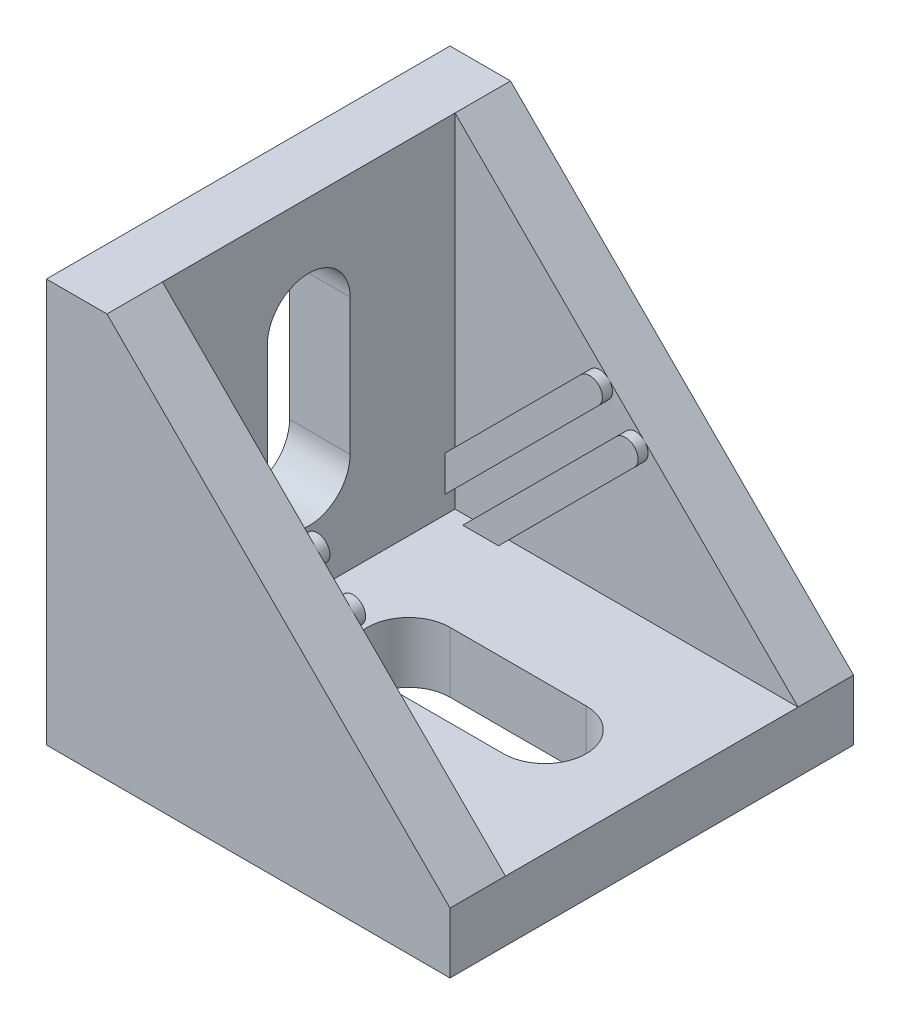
ISO-10303-21;
HEADER;
FILE_DESCRIPTION(('STEP AP214'),'2;1');
FILE_NAME('part.step','',(''),(''),'','','');
FILE_SCHEMA(('AUTOMOTIVE_DESIGN { 1 0 10303 214 1 1 1 1 }'));
ENDSEC;
DATA;
#1=APPLICATION_CONTEXT('core data for automotive mechanical design processes');
#2=APPLICATION_PROTOCOL_DEFINITION('international standard','automotive_design',2000,#1);
#3=PRODUCT_CONTEXT('',#1,'mechanical');
#4=PRODUCT('Part','Part','',(#3));
#5=PRODUCT_RELATED_PRODUCT_CATEGORY('part','',(#4));
#6=PRODUCT_DEFINITION_FORMATION('','',#4);
#7=PRODUCT_DEFINITION_CONTEXT('part definition',#1,'design');
#8=PRODUCT_DEFINITION('design','',#6,#7);
#9=PRODUCT_DEFINITION_SHAPE('','',#8);
#10=(LENGTH_UNIT() NAMED_UNIT(*) SI_UNIT(.MILLI.,.METRE.));
#11=(NAMED_UNIT(*) PLANE_ANGLE_UNIT() SI_UNIT($,.RADIAN.));
#12=(NAMED_UNIT(*) SI_UNIT($,.STERADIAN.) SOLID_ANGLE_UNIT());
#13=UNCERTAINTY_MEASURE_WITH_UNIT(LENGTH_MEASURE(1.E-05),#10,'distance_accuracy_value','');
#14=(GEOMETRIC_REPRESENTATION_CONTEXT(3) GLOBAL_UNCERTAINTY_ASSIGNED_CONTEXT((#13)) GLOBAL_UNIT_ASSIGNED_CONTEXT((#10,
#11,#12)) REPRESENTATION_CONTEXT('',''));
#15=CARTESIAN_POINT('',(0.,0.,0.));
#16=DIRECTION('',(0.,0.,1.));
#17=DIRECTION('',(1.,0.,0.));
#18=AXIS2_PLACEMENT_3D('',#15,#16,#17);
#19=CARTESIAN_POINT('',(24.7677669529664,19.4644660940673,13.5));
#20=DIRECTION('',(0.707106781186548,-0.707106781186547,0.));
#21=DIRECTION('',(0.,0.,1.));
#22=AXIS2_PLACEMENT_3D('',#19,#20,#21);
#23=PLANE('',#22);
#24=DIRECTION('',(-0.707106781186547,-0.707106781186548,0.));
#25=VECTOR('',#24,1.);
#26=CARTESIAN_POINT('',(24.7677669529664,19.4644660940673,14.5));
#27=LINE('',#26,#25);
#28=CARTESIAN_POINT('',(24.7677669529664,19.4644660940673,14.5));
#29=VERTEX_POINT('',#28);
#30=CARTESIAN_POINT('',(11.3033008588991,6.,14.5));
#31=VERTEX_POINT('',#30);
#32=EDGE_CURVE('E518',#29,#31,#27,.T.);
#33=ORIENTED_EDGE('',*,*,#32,.T.);
#34=DIRECTION('',(0.,0.,-1.));
#35=VECTOR('',#34,1.);
#36=CARTESIAN_POINT('',(11.3033008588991,6.,14.));
#37=LINE('',#36,#35);
#38=CARTESIAN_POINT('',(11.3033008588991,6.,13.5));
#39=VERTEX_POINT('',#38);
#40=EDGE_CURVE('E402',#31,#39,#37,.T.);
#41=ORIENTED_EDGE('',*,*,#40,.T.);
#42=DIRECTION('',(-0.707106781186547,-0.707106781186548,0.));
#43=VECTOR('',#42,1.);
#44=CARTESIAN_POINT('',(24.7677669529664,19.4644660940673,13.5));
#45=LINE('',#44,#43);
#46=CARTESIAN_POINT('',(24.7677669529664,19.4644660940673,13.5));
#47=VERTEX_POINT('',#46);
#48=EDGE_CURVE('E19',#47,#39,#45,.T.);
#49=ORIENTED_EDGE('',*,*,#48,.F.);
#50=DIRECTION('',(0.,0.,-1.));
#51=VECTOR('',#50,1.);
#52=CARTESIAN_POINT('',(24.7677669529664,19.4644660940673,14.));
#53=LINE('',#52,#51);
#54=EDGE_CURVE('E400',#29,#47,#53,.T.);
#55=ORIENTED_EDGE('',*,*,#54,.F.);
#56=EDGE_LOOP('',(#33,#41,#49,#55));
#57=FACE_BOUND('',#56,.T.);
#58=ADVANCED_FACE('F15',(#57),#23,.T.);
#59=CARTESIAN_POINT('',(24.7677669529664,19.4644660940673,-14.5));
#60=DIRECTION('',(0.707106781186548,-0.707106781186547,0.));
#61=DIRECTION('',(0.707106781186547,0.707106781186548,0.));
#62=AXIS2_PLACEMENT_3D('',#59,#60,#61);
#63=PLANE('',#62);
#64=DIRECTION('',(0.707106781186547,0.707106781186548,0.));
#65=VECTOR('',#64,1.);
#66=CARTESIAN_POINT('',(11.3033008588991,6.,-14.5));
#67=LINE('',#66,#65);
#68=CARTESIAN_POINT('',(11.3033008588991,6.,-14.5));
#69=VERTEX_POINT('',#68);
#70=CARTESIAN_POINT('',(24.7677669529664,19.4644660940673,-14.5));
#71=VERTEX_POINT('',#70);
#72=EDGE_CURVE('E517',#69,#71,#67,.T.);
#73=ORIENTED_EDGE('',*,*,#72,.T.);
#74=DIRECTION('',(0.,0.,1.));
#75=VECTOR('',#74,1.);
#76=CARTESIAN_POINT('',(24.7677669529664,19.4644660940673,-14.5));
#77=LINE('',#76,#75);
#78=CARTESIAN_POINT('',(24.7677669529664,19.4644660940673,-13.5));
#79=VERTEX_POINT('',#78);
#80=EDGE_CURVE('E549',#79,#71,#77,.F.);
#81=ORIENTED_EDGE('',*,*,#80,.F.);
#82=DIRECTION('',(0.707106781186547,0.707106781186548,0.));
#83=VECTOR('',#82,1.);
#84=CARTESIAN_POINT('',(11.3033008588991,6.,-13.5));
#85=LINE('',#84,#83);
#86=CARTESIAN_POINT('',(11.3033008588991,6.,-13.5));
#87=VERTEX_POINT('',#86);
#88=EDGE_CURVE('E406',#87,#79,#85,.T.);
#89=ORIENTED_EDGE('',*,*,#88,.F.);
#90=DIRECTION('',(0.,0.,1.));
#91=VECTOR('',#90,1.);
#92=CARTESIAN_POINT('',(11.3033008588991,5.99999999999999,-14.5));
#93=LINE('',#92,#91);
#94=EDGE_CURVE('E572',#87,#69,#93,.F.);
#95=ORIENTED_EDGE('',*,*,#94,.T.);
#96=EDGE_LOOP('',(#73,#81,#89,#95));
#97=FACE_BOUND('',#96,.T.);
#98=ADVANCED_FACE('F576',(#97),#63,.T.);
#99=CARTESIAN_POINT('',(34.7878679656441,-2.26274169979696,0.));
#100=DIRECTION('',(0.707106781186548,0.707106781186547,0.));
#101=DIRECTION('',(-0.707106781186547,0.707106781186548,0.));
#102=AXIS2_PLACEMENT_3D('',#99,#100,#101);
#103=PLANE('',#102);
#104=DIRECTION('',(-0.707106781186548,0.707106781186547,0.));
#105=VECTOR('',#104,1.);
#106=CARTESIAN_POINT('',(35.212132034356,-2.68700576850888,-4.1));
#107=LINE('',#106,#105);
#108=CARTESIAN_POINT('',(35.212132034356,-2.68700576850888,-4.1));
#109=VERTEX_POINT('',#108);
#110=CARTESIAN_POINT('',(34.3636038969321,-1.83847763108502,-4.1));
#111=VERTEX_POINT('',#110);
#112=EDGE_CURVE('E564',#109,#111,#107,.T.);
#113=ORIENTED_EDGE('',*,*,#112,.F.);
#114=DIRECTION('',(0.,0.,1.));
#115=VECTOR('',#114,1.);
#116=CARTESIAN_POINT('',(35.212132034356,-2.68700576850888,4.09999999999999));
#117=LINE('',#116,#115);
#118=CARTESIAN_POINT('',(35.212132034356,-2.68700576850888,4.1));
#119=VERTEX_POINT('',#118);
#120=EDGE_CURVE('E516',#119,#109,#117,.F.);
#121=ORIENTED_EDGE('',*,*,#120,.F.);
#122=DIRECTION('',(0.707106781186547,-0.707106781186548,0.));
#123=VECTOR('',#122,1.);
#124=CARTESIAN_POINT('',(34.3636038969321,-1.83847763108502,4.1));
#125=LINE('',#124,#123);
#126=CARTESIAN_POINT('',(34.3636038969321,-1.83847763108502,4.1));
#127=VERTEX_POINT('',#126);
#128=EDGE_CURVE('E569',#127,#119,#125,.T.);
#129=ORIENTED_EDGE('',*,*,#128,.F.);
#130=DIRECTION('',(0.,0.,1.));
#131=VECTOR('',#130,1.);
#132=CARTESIAN_POINT('',(34.3636038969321,-1.83847763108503,-4.1));
#133=LINE('',#132,#131);
#134=EDGE_CURVE('E714',#111,#127,#133,.T.);
#135=ORIENTED_EDGE('',*,*,#134,.F.);
#136=EDGE_LOOP('',(#113,#121,#129,#135));
#137=FACE_BOUND('',#136,.T.);
#138=ADVANCED_FACE('F1016',(#137),#103,.F.);
#139=CARTESIAN_POINT('',(37.1920310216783,0.989949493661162,4.1));
#140=DIRECTION('',(0.,0.,1.));
#141=DIRECTION('',(1.,0.,0.));
#142=AXIS2_PLACEMENT_3D('',#139,#140,#141);
#143=PLANE('',#142);
#144=DIRECTION('',(-0.707106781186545,0.70710678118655,0.));
#145=VECTOR('',#144,1.);
#146=CARTESIAN_POINT('',(38.0405591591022,0.141421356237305,4.1));
#147=LINE('',#146,#145);
#148=CARTESIAN_POINT('',(38.0405591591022,0.141421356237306,4.1));
#149=VERTEX_POINT('',#148);
#150=CARTESIAN_POINT('',(37.1920310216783,0.989949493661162,4.1));
#151=VERTEX_POINT('',#150);
#152=EDGE_CURVE('E567',#149,#151,#147,.T.);
#153=ORIENTED_EDGE('',*,*,#152,.T.);
#154=DIRECTION('',(-0.707106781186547,-0.707106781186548,0.));
#155=VECTOR('',#154,1.);
#156=CARTESIAN_POINT('',(37.1920310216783,0.989949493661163,4.1));
#157=LINE('',#156,#155);
#158=EDGE_CURVE('E711',#127,#151,#157,.F.);
#159=ORIENTED_EDGE('',*,*,#158,.F.);
#160=ORIENTED_EDGE('',*,*,#128,.T.);
#161=DIRECTION('',(0.707106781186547,0.707106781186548,0.));
#162=VECTOR('',#161,1.);
#163=CARTESIAN_POINT('',(38.0405591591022,0.141421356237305,4.09999999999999));
#164=LINE('',#163,#162);
#165=EDGE_CURVE('E717',#149,#119,#164,.F.);
#166=ORIENTED_EDGE('',*,*,#165,.F.);
#167=EDGE_LOOP('',(#153,#159,#160,#166));
#168=FACE_BOUND('',#167,.T.);
#169=ADVANCED_FACE('F1012',(#168),#143,.T.);
#170=CARTESIAN_POINT('',(38.0405591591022,0.141421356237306,-4.1));
#171=DIRECTION('',(0.,0.,-1.));
#172=DIRECTION('',(-1.,0.,0.));
#173=AXIS2_PLACEMENT_3D('',#170,#171,#172);
#174=PLANE('',#173);
#175=DIRECTION('',(0.707106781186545,-0.70710678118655,0.));
#176=VECTOR('',#175,1.);
#177=CARTESIAN_POINT('',(37.1920310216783,0.989949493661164,-4.1));
#178=LINE('',#177,#176);
#179=CARTESIAN_POINT('',(37.1920310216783,0.989949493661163,-4.1));
#180=VERTEX_POINT('',#179);
#181=CARTESIAN_POINT('',(38.0405591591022,0.141421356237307,-4.1));
#182=VERTEX_POINT('',#181);
#183=EDGE_CURVE('E562',#180,#182,#178,.T.);
#184=ORIENTED_EDGE('',*,*,#183,.T.);
#185=DIRECTION('',(0.707106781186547,0.707106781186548,0.));
#186=VECTOR('',#185,1.);
#187=CARTESIAN_POINT('',(38.0405591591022,0.141421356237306,-4.1));
#188=LINE('',#187,#186);
#189=EDGE_CURVE('E720',#109,#182,#188,.T.);
#190=ORIENTED_EDGE('',*,*,#189,.F.);
#191=ORIENTED_EDGE('',*,*,#112,.T.);
#192=DIRECTION('',(-0.707106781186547,-0.707106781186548,0.));
#193=VECTOR('',#192,1.);
#194=CARTESIAN_POINT('',(37.1920310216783,0.989949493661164,-4.1));
#195=LINE('',#194,#193);
#196=EDGE_CURVE('E700',#180,#111,#195,.T.);
#197=ORIENTED_EDGE('',*,*,#196,.F.);
#198=EDGE_LOOP('',(#184,#190,#191,#197));
#199=FACE_BOUND('',#198,.T.);
#200=ADVANCED_FACE('F1009',(#199),#174,.T.);
#201=CARTESIAN_POINT('',(6.00000000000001,11.3033008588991,-14.5));
#202=DIRECTION('',(-0.707106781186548,0.707106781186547,0.));
#203=DIRECTION('',(-0.707106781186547,-0.707106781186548,0.));
#204=AXIS2_PLACEMENT_3D('',#201,#202,#203);
#205=PLANE('',#204);
#206=DIRECTION('',(-0.707106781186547,-0.707106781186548,0.));
#207=VECTOR('',#206,1.);
#208=CARTESIAN_POINT('',(19.4644660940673,24.7677669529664,-14.5));
#209=LINE('',#208,#207);
#210=CARTESIAN_POINT('',(19.4644660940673,24.7677669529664,-14.5));
#211=VERTEX_POINT('',#210);
#212=CARTESIAN_POINT('',(6.00000000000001,11.3033008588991,-14.5));
#213=VERTEX_POINT('',#212);
#214=EDGE_CURVE('E510',#211,#213,#209,.T.);
#215=ORIENTED_EDGE('',*,*,#214,.T.);
#216=DIRECTION('',(0.,0.,1.));
#217=VECTOR('',#216,1.);
#218=CARTESIAN_POINT('',(6.00000000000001,11.3033008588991,-14.5));
#219=LINE('',#218,#217);
#220=CARTESIAN_POINT('',(6.00000000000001,11.3033008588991,-13.5));
#221=VERTEX_POINT('',#220);
#222=EDGE_CURVE('E557',#213,#221,#219,.T.);
#223=ORIENTED_EDGE('',*,*,#222,.T.);
#224=DIRECTION('',(-0.707106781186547,-0.707106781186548,0.));
#225=VECTOR('',#224,1.);
#226=CARTESIAN_POINT('',(19.4644660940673,24.7677669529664,-13.5));
#227=LINE('',#226,#225);
#228=CARTESIAN_POINT('',(19.4644660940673,24.7677669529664,-13.5));
#229=VERTEX_POINT('',#228);
#230=EDGE_CURVE('E509',#229,#221,#227,.T.);
#231=ORIENTED_EDGE('',*,*,#230,.F.);
#232=DIRECTION('',(0.,0.,1.));
#233=VECTOR('',#232,1.);
#234=CARTESIAN_POINT('',(19.4644660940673,24.7677669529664,-14.5));
#235=LINE('',#234,#233);
#236=EDGE_CURVE('E554',#211,#229,#235,.T.);
#237=ORIENTED_EDGE('',*,*,#236,.F.);
#238=EDGE_LOOP('',(#215,#223,#231,#237));
#239=FACE_BOUND('',#238,.T.);
#240=ADVANCED_FACE('F752',(#239),#205,.T.);
#241=CARTESIAN_POINT('',(20.3483495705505,23.8838834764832,-14.5));
#242=DIRECTION('',(0.,0.,1.));
#243=DIRECTION('',(1.,0.,0.));
#244=AXIS2_PLACEMENT_3D('',#241,#242,#243);
#245=CYLINDRICAL_SURFACE('',#244,1.25);
#246=CARTESIAN_POINT('',(20.3483495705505,23.8838834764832,-14.5));
#247=DIRECTION('',(0.,0.,1.));
#248=DIRECTION('',(1.,0.,0.));
#249=AXIS2_PLACEMENT_3D('',#246,#247,#248);
#250=CIRCLE('',#249,1.25);
#251=CARTESIAN_POINT('',(21.2322330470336,24.7677669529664,-14.5));
#252=VERTEX_POINT('',#251);
#253=EDGE_CURVE('E506',#252,#211,#250,.T.);
#254=ORIENTED_EDGE('',*,*,#253,.T.);
#255=ORIENTED_EDGE('',*,*,#236,.T.);
#256=CARTESIAN_POINT('',(20.3483495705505,23.8838834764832,-13.5));
#257=DIRECTION('',(0.,0.,1.));
#258=DIRECTION('',(1.,0.,0.));
#259=AXIS2_PLACEMENT_3D('',#256,#257,#258);
#260=CIRCLE('',#259,1.25);
#261=CARTESIAN_POINT('',(21.2322330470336,23.,-13.5));
#262=VERTEX_POINT('',#261);
#263=EDGE_CURVE('E502',#262,#229,#260,.T.);
#264=ORIENTED_EDGE('',*,*,#263,.F.);
#265=DIRECTION('',(0.,0.,1.));
#266=VECTOR('',#265,1.);
#267=CARTESIAN_POINT('',(21.2322330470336,23.,-14.5));
#268=LINE('',#267,#266);
#269=CARTESIAN_POINT('',(21.2322330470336,23.,-14.5));
#270=VERTEX_POINT('',#269);
#271=EDGE_CURVE('E407',#270,#262,#268,.T.);
#272=ORIENTED_EDGE('',*,*,#271,.F.);
#273=CARTESIAN_POINT('',(20.3483495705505,23.8838834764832,-14.5));
#274=DIRECTION('',(0.,0.,1.));
#275=DIRECTION('',(1.,0.,0.));
#276=AXIS2_PLACEMENT_3D('',#273,#274,#275);
#277=CIRCLE('',#276,1.25);
#278=EDGE_CURVE('E500',#270,#252,#277,.T.);
#279=ORIENTED_EDGE('',*,*,#278,.T.);
#280=EDGE_LOOP('',(#254,#255,#264,#272,#279));
#281=FACE_BOUND('',#280,.T.);
#282=ADVANCED_FACE('F754',(#281),#245,.T.);
#283=CARTESIAN_POINT('',(23.8838834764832,20.3483495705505,-14.5));
#284=DIRECTION('',(0.,0.,1.));
#285=DIRECTION('',(1.,0.,0.));
#286=AXIS2_PLACEMENT_3D('',#283,#284,#285);
#287=CYLINDRICAL_SURFACE('',#286,1.25);
#288=CARTESIAN_POINT('',(23.8838834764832,20.3483495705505,-14.5));
#289=DIRECTION('',(0.,0.,1.));
#290=DIRECTION('',(1.,0.,0.));
#291=AXIS2_PLACEMENT_3D('',#288,#289,#290);
#292=CIRCLE('',#291,1.25);
#293=CARTESIAN_POINT('',(24.7677669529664,21.2322330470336,-14.5));
#294=VERTEX_POINT('',#293);
#295=CARTESIAN_POINT('',(23.,21.2322330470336,-14.5));
#296=VERTEX_POINT('',#295);
#297=EDGE_CURVE('E497',#294,#296,#292,.T.);
#298=ORIENTED_EDGE('',*,*,#297,.T.);
#299=DIRECTION('',(0.,0.,1.));
#300=VECTOR('',#299,1.);
#301=CARTESIAN_POINT('',(23.,21.2322330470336,-14.5));
#302=LINE('',#301,#300);
#303=CARTESIAN_POINT('',(23.,21.2322330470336,-13.5));
#304=VERTEX_POINT('',#303);
#305=EDGE_CURVE('E546',#304,#296,#302,.F.);
#306=ORIENTED_EDGE('',*,*,#305,.F.);
#307=CARTESIAN_POINT('',(23.8838834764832,20.3483495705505,-13.5));
#308=DIRECTION('',(0.,0.,1.));
#309=DIRECTION('',(1.,0.,0.));
#310=AXIS2_PLACEMENT_3D('',#307,#308,#309);
#311=CIRCLE('',#310,1.25);
#312=EDGE_CURVE('E520',#79,#304,#311,.T.);
#313=ORIENTED_EDGE('',*,*,#312,.F.);
#314=ORIENTED_EDGE('',*,*,#80,.T.);
#315=CARTESIAN_POINT('',(23.8838834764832,20.3483495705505,-14.5));
#316=DIRECTION('',(0.,0.,1.));
#317=DIRECTION('',(1.,0.,0.));
#318=AXIS2_PLACEMENT_3D('',#315,#316,#317);
#319=CIRCLE('',#318,1.25);
#320=EDGE_CURVE('E514',#71,#294,#319,.T.);
#321=ORIENTED_EDGE('',*,*,#320,.T.);
#322=EDGE_LOOP('',(#298,#306,#313,#314,#321));
#323=FACE_BOUND('',#322,.T.);
#324=ADVANCED_FACE('F739',(#323),#287,.T.);
#325=CARTESIAN_POINT('',(7.76776695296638,6.,-14.5));
#326=DIRECTION('',(-0.707106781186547,0.707106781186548,0.));
#327=DIRECTION('',(-0.707106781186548,-0.707106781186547,0.));
#328=AXIS2_PLACEMENT_3D('',#325,#326,#327);
#329=PLANE('',#328);
#330=DIRECTION('',(-0.707106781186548,-0.707106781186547,0.));
#331=VECTOR('',#330,1.);
#332=CARTESIAN_POINT('',(23.,21.2322330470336,-14.5));
#333=LINE('',#332,#331);
#334=CARTESIAN_POINT('',(7.76776695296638,6.,-14.5));
#335=VERTEX_POINT('',#334);
#336=EDGE_CURVE('E499',#296,#335,#333,.T.);
#337=ORIENTED_EDGE('',*,*,#336,.T.);
#338=DIRECTION('',(0.,0.,1.));
#339=VECTOR('',#338,1.);
#340=CARTESIAN_POINT('',(7.76776695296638,6.,-14.5));
#341=LINE('',#340,#339);
#342=CARTESIAN_POINT('',(7.76776695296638,6.,-13.5));
#343=VERTEX_POINT('',#342);
#344=EDGE_CURVE('E541',#335,#343,#341,.T.);
#345=ORIENTED_EDGE('',*,*,#344,.T.);
#346=DIRECTION('',(-0.707106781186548,-0.707106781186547,0.));
#347=VECTOR('',#346,1.);
#348=CARTESIAN_POINT('',(23.,21.2322330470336,-13.5));
#349=LINE('',#348,#347);
#350=EDGE_CURVE('E522',#304,#343,#349,.T.);
#351=ORIENTED_EDGE('',*,*,#350,.F.);
#352=ORIENTED_EDGE('',*,*,#305,.T.);
#353=EDGE_LOOP('',(#337,#345,#351,#352));
#354=FACE_BOUND('',#353,.T.);
#355=ADVANCED_FACE('F742',(#354),#329,.T.);
#356=CARTESIAN_POINT('',(21.2322330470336,23.,-14.5));
#357=DIRECTION('',(0.707106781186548,-0.707106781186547,0.));
#358=DIRECTION('',(0.707106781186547,0.707106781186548,0.));
#359=AXIS2_PLACEMENT_3D('',#356,#357,#358);
#360=PLANE('',#359);
#361=DIRECTION('',(0.707106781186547,0.707106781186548,0.));
#362=VECTOR('',#361,1.);
#363=CARTESIAN_POINT('',(6.00000000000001,7.76776695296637,-14.5));
#364=LINE('',#363,#362);
#365=CARTESIAN_POINT('',(6.00000000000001,7.76776695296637,-14.5));
#366=VERTEX_POINT('',#365);
#367=EDGE_CURVE('E666',#366,#270,#364,.T.);
#368=ORIENTED_EDGE('',*,*,#367,.T.);
#369=ORIENTED_EDGE('',*,*,#271,.T.);
#370=DIRECTION('',(0.707106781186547,0.707106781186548,0.));
#371=VECTOR('',#370,1.);
#372=CARTESIAN_POINT('',(6.00000000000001,7.76776695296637,-13.5));
#373=LINE('',#372,#371);
#374=CARTESIAN_POINT('',(6.00000000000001,7.76776695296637,-13.5));
#375=VERTEX_POINT('',#374);
#376=EDGE_CURVE('E505',#375,#262,#373,.T.);
#377=ORIENTED_EDGE('',*,*,#376,.F.);
#378=DIRECTION('',(0.,0.,1.));
#379=VECTOR('',#378,1.);
#380=CARTESIAN_POINT('',(6.00000000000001,7.76776695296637,-14.5));
#381=LINE('',#380,#379);
#382=EDGE_CURVE('E539',#375,#366,#381,.F.);
#383=ORIENTED_EDGE('',*,*,#382,.T.);
#384=EDGE_LOOP('',(#368,#369,#377,#383));
#385=FACE_BOUND('',#384,.T.);
#386=ADVANCED_FACE('F747',(#385),#360,.T.);
#387=CARTESIAN_POINT('',(7.76776695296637,21.754333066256,13.5));
#388=DIRECTION('',(0.,0.,-1.));
#389=DIRECTION('',(1.,0.,0.));
#390=AXIS2_PLACEMENT_3D('',#387,#388,#389);
#391=PLANE('',#390);
#392=CARTESIAN_POINT('',(23.8838834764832,20.3483495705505,13.5));
#393=DIRECTION('',(0.,0.,-1.));
#394=DIRECTION('',(-1.,0.,0.));
#395=AXIS2_PLACEMENT_3D('',#392,#393,#394);
#396=CIRCLE('',#395,1.25);
#397=CARTESIAN_POINT('',(23.,21.2322330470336,13.5));
#398=VERTEX_POINT('',#397);
#399=EDGE_CURVE('E409',#47,#398,#396,.F.);
#400=ORIENTED_EDGE('',*,*,#399,.F.);
#401=ORIENTED_EDGE('',*,*,#48,.T.);
#402=DIRECTION('',(1.,0.,0.));
#403=VECTOR('',#402,1.);
#404=CARTESIAN_POINT('',(23.,6.,13.5));
#405=LINE('',#404,#403);
#406=CARTESIAN_POINT('',(7.76776695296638,6.,13.5));
#407=VERTEX_POINT('',#406);
#408=EDGE_CURVE('E534',#407,#39,#405,.T.);
#409=ORIENTED_EDGE('',*,*,#408,.F.);
#410=DIRECTION('',(-0.707106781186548,-0.707106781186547,0.));
#411=VECTOR('',#410,1.);
#412=CARTESIAN_POINT('',(15.3838834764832,13.6161165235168,13.5));
#413=LINE('',#412,#411);
#414=EDGE_CURVE('E411',#398,#407,#413,.T.);
#415=ORIENTED_EDGE('',*,*,#414,.F.);
#416=EDGE_LOOP('',(#400,#401,#409,#415));
#417=FACE_BOUND('',#416,.T.);
#418=ADVANCED_FACE('F410',(#417),#391,.T.);
#419=CARTESIAN_POINT('',(16.7406394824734,13.2970890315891,-13.5));
#420=DIRECTION('',(0.,0.,1.));
#421=DIRECTION('',(1.,0.,0.));
#422=AXIS2_PLACEMENT_3D('',#419,#420,#421);
#423=PLANE('',#422);
#424=ORIENTED_EDGE('',*,*,#312,.T.);
#425=ORIENTED_EDGE('',*,*,#350,.T.);
#426=DIRECTION('',(1.,0.,0.));
#427=VECTOR('',#426,1.);
#428=CARTESIAN_POINT('',(23.,6.,-13.5));
#429=LINE('',#428,#427);
#430=EDGE_CURVE('E429',#87,#343,#429,.F.);
#431=ORIENTED_EDGE('',*,*,#430,.F.);
#432=ORIENTED_EDGE('',*,*,#88,.T.);
#433=EDGE_LOOP('',(#424,#425,#431,#432));
#434=FACE_BOUND('',#433,.T.);
#435=ADVANCED_FACE('F743',(#434),#423,.T.);
#436=CARTESIAN_POINT('',(23.,21.2322330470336,14.5));
#437=DIRECTION('',(-0.707106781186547,0.707106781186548,0.));
#438=DIRECTION('',(0.,0.,-1.));
#439=AXIS2_PLACEMENT_3D('',#436,#437,#438);
#440=PLANE('',#439);
#441=DIRECTION('',(0.707106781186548,0.707106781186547,0.));
#442=VECTOR('',#441,1.);
#443=CARTESIAN_POINT('',(7.76776695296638,6.,14.5));
#444=LINE('',#443,#442);
#445=CARTESIAN_POINT('',(7.76776695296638,6.,14.5));
#446=VERTEX_POINT('',#445);
#447=CARTESIAN_POINT('',(23.,21.2322330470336,14.5));
#448=VERTEX_POINT('',#447);
#449=EDGE_CURVE('E496',#446,#448,#444,.T.);
#450=ORIENTED_EDGE('',*,*,#449,.T.);
#451=DIRECTION('',(0.,0.,1.));
#452=VECTOR('',#451,1.);
#453=CARTESIAN_POINT('',(23.,21.2322330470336,14.));
#454=LINE('',#453,#452);
#455=EDGE_CURVE('E415',#398,#448,#454,.T.);
#456=ORIENTED_EDGE('',*,*,#455,.F.);
#457=ORIENTED_EDGE('',*,*,#414,.T.);
#458=DIRECTION('',(0.,0.,1.));
#459=VECTOR('',#458,1.);
#460=CARTESIAN_POINT('',(7.76776695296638,6.,0.));
#461=LINE('',#460,#459);
#462=EDGE_CURVE('E537',#446,#407,#461,.F.);
#463=ORIENTED_EDGE('',*,*,#462,.F.);
#464=EDGE_LOOP('',(#450,#456,#457,#463));
#465=FACE_BOUND('',#464,.T.);
#466=ADVANCED_FACE('F793',(#465),#440,.T.);
#467=CARTESIAN_POINT('',(23.8838834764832,20.3483495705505,14.5));
#468=DIRECTION('',(0.,0.,-1.));
#469=DIRECTION('',(-1.,0.,0.));
#470=AXIS2_PLACEMENT_3D('',#467,#468,#469);
#471=CYLINDRICAL_SURFACE('',#470,1.25);
#472=CARTESIAN_POINT('',(23.8838834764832,20.3483495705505,14.5));
#473=DIRECTION('',(0.,0.,-1.));
#474=DIRECTION('',(-1.,0.,0.));
#475=AXIS2_PLACEMENT_3D('',#472,#473,#474);
#476=CIRCLE('',#475,1.25);
#477=CARTESIAN_POINT('',(24.7677669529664,21.2322330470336,14.5));
#478=VERTEX_POINT('',#477);
#479=EDGE_CURVE('E419',#478,#29,#476,.T.);
#480=ORIENTED_EDGE('',*,*,#479,.T.);
#481=ORIENTED_EDGE('',*,*,#54,.T.);
#482=ORIENTED_EDGE('',*,*,#399,.T.);
#483=ORIENTED_EDGE('',*,*,#455,.T.);
#484=CARTESIAN_POINT('',(23.8838834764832,20.3483495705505,14.5));
#485=DIRECTION('',(0.,0.,-1.));
#486=DIRECTION('',(-1.,0.,0.));
#487=AXIS2_PLACEMENT_3D('',#484,#485,#486);
#488=CIRCLE('',#487,1.25);
#489=EDGE_CURVE('E494',#448,#478,#488,.T.);
#490=ORIENTED_EDGE('',*,*,#489,.T.);
#491=EDGE_LOOP('',(#480,#481,#482,#483,#490));
#492=FACE_BOUND('',#491,.T.);
#493=ADVANCED_FACE('F417',(#492),#471,.T.);
#494=CARTESIAN_POINT('',(19.4644660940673,24.7677669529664,14.5));
#495=DIRECTION('',(-0.707106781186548,0.707106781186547,0.));
#496=DIRECTION('',(0.,0.,-1.));
#497=AXIS2_PLACEMENT_3D('',#494,#495,#496);
#498=PLANE('',#497);
#499=DIRECTION('',(0.707106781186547,0.707106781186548,0.));
#500=VECTOR('',#499,1.);
#501=CARTESIAN_POINT('',(6.00000000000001,11.3033008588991,14.5));
#502=LINE('',#501,#500);
#503=CARTESIAN_POINT('',(6.,11.3033008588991,14.5));
#504=VERTEX_POINT('',#503);
#505=CARTESIAN_POINT('',(19.4644660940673,24.7677669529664,14.5));
#506=VERTEX_POINT('',#505);
#507=EDGE_CURVE('E513',#504,#506,#502,.T.);
#508=ORIENTED_EDGE('',*,*,#507,.T.);
#509=DIRECTION('',(0.,0.,1.));
#510=VECTOR('',#509,1.);
#511=CARTESIAN_POINT('',(19.4644660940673,24.7677669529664,14.));
#512=LINE('',#511,#510);
#513=CARTESIAN_POINT('',(19.4644660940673,24.7677669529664,13.5));
#514=VERTEX_POINT('',#513);
#515=EDGE_CURVE('E423',#514,#506,#512,.T.);
#516=ORIENTED_EDGE('',*,*,#515,.F.);
#517=DIRECTION('',(0.707106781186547,0.707106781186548,0.));
#518=VECTOR('',#517,1.);
#519=CARTESIAN_POINT('',(6.00000000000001,11.3033008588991,13.5));
#520=LINE('',#519,#518);
#521=CARTESIAN_POINT('',(6.00000000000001,11.3033008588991,13.5));
#522=VERTEX_POINT('',#521);
#523=EDGE_CURVE('E488',#522,#514,#520,.T.);
#524=ORIENTED_EDGE('',*,*,#523,.F.);
#525=DIRECTION('',(0.,0.,1.));
#526=VECTOR('',#525,1.);
#527=CARTESIAN_POINT('',(6.00000000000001,11.3033008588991,14.));
#528=LINE('',#527,#526);
#529=EDGE_CURVE('E421',#522,#504,#528,.T.);
#530=ORIENTED_EDGE('',*,*,#529,.T.);
#531=EDGE_LOOP('',(#508,#516,#524,#530));
#532=FACE_BOUND('',#531,.T.);
#533=ADVANCED_FACE('F783',(#532),#498,.T.);
#534=CARTESIAN_POINT('',(20.3483495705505,23.8838834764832,14.5));
#535=DIRECTION('',(0.,0.,-1.));
#536=DIRECTION('',(-1.,0.,0.));
#537=AXIS2_PLACEMENT_3D('',#534,#535,#536);
#538=CYLINDRICAL_SURFACE('',#537,1.25);
#539=CARTESIAN_POINT('',(20.3483495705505,23.8838834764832,14.5));
#540=DIRECTION('',(0.,0.,-1.));
#541=DIRECTION('',(-1.,0.,0.));
#542=AXIS2_PLACEMENT_3D('',#539,#540,#541);
#543=CIRCLE('',#542,1.25);
#544=CARTESIAN_POINT('',(21.2322330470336,24.7677669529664,14.5));
#545=VERTEX_POINT('',#544);
#546=CARTESIAN_POINT('',(21.2322330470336,23.,14.5));
#547=VERTEX_POINT('',#546);
#548=EDGE_CURVE('E491',#545,#547,#543,.T.);
#549=ORIENTED_EDGE('',*,*,#548,.T.);
#550=DIRECTION('',(0.,0.,1.));
#551=VECTOR('',#550,1.);
#552=CARTESIAN_POINT('',(21.2322330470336,23.,14.));
#553=LINE('',#552,#551);
#554=CARTESIAN_POINT('',(21.2322330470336,23.,13.5));
#555=VERTEX_POINT('',#554);
#556=EDGE_CURVE('E651',#555,#547,#553,.T.);
#557=ORIENTED_EDGE('',*,*,#556,.F.);
#558=CARTESIAN_POINT('',(20.3483495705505,23.8838834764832,13.5));
#559=DIRECTION('',(0.,0.,-1.));
#560=DIRECTION('',(-1.,0.,0.));
#561=AXIS2_PLACEMENT_3D('',#558,#559,#560);
#562=CIRCLE('',#561,1.25);
#563=EDGE_CURVE('E485',#514,#555,#562,.T.);
#564=ORIENTED_EDGE('',*,*,#563,.F.);
#565=ORIENTED_EDGE('',*,*,#515,.T.);
#566=CARTESIAN_POINT('',(20.3483495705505,23.8838834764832,14.5));
#567=DIRECTION('',(0.,0.,-1.));
#568=DIRECTION('',(-1.,0.,0.));
#569=AXIS2_PLACEMENT_3D('',#566,#567,#568);
#570=CIRCLE('',#569,1.25);
#571=EDGE_CURVE('E511',#506,#545,#570,.T.);
#572=ORIENTED_EDGE('',*,*,#571,.T.);
#573=EDGE_LOOP('',(#549,#557,#564,#565,#572));
#574=FACE_BOUND('',#573,.T.);
#575=ADVANCED_FACE('F787',(#574),#538,.T.);
#576=CARTESIAN_POINT('',(21.2322330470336,23.,13.5));
#577=DIRECTION('',(0.707106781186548,-0.707106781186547,0.));
#578=DIRECTION('',(0.,0.,1.));
#579=AXIS2_PLACEMENT_3D('',#576,#577,#578);
#580=PLANE('',#579);
#581=DIRECTION('',(-0.707106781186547,-0.707106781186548,0.));
#582=VECTOR('',#581,1.);
#583=CARTESIAN_POINT('',(21.2322330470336,23.,14.5));
#584=LINE('',#583,#582);
#585=CARTESIAN_POINT('',(6.00000000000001,7.76776695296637,14.5));
#586=VERTEX_POINT('',#585);
#587=EDGE_CURVE('E553',#547,#586,#584,.T.);
#588=ORIENTED_EDGE('',*,*,#587,.T.);
#589=DIRECTION('',(0.,0.,-1.));
#590=VECTOR('',#589,1.);
#591=CARTESIAN_POINT('',(6.,7.76776695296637,14.));
#592=LINE('',#591,#590);
#593=CARTESIAN_POINT('',(6.00000000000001,7.76776695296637,13.5));
#594=VERTEX_POINT('',#593);
#595=EDGE_CURVE('E650',#586,#594,#592,.T.);
#596=ORIENTED_EDGE('',*,*,#595,.T.);
#597=DIRECTION('',(-0.707106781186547,-0.707106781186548,0.));
#598=VECTOR('',#597,1.);
#599=CARTESIAN_POINT('',(21.2322330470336,23.,13.5));
#600=LINE('',#599,#598);
#601=EDGE_CURVE('E481',#555,#594,#600,.T.);
#602=ORIENTED_EDGE('',*,*,#601,.F.);
#603=ORIENTED_EDGE('',*,*,#556,.T.);
#604=EDGE_LOOP('',(#588,#596,#602,#603));
#605=FACE_BOUND('',#604,.T.);
#606=ADVANCED_FACE('F684',(#605),#580,.T.);
#607=CARTESIAN_POINT('',(1.10588745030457,-2.26274169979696,0.));
#608=DIRECTION('',(0.707106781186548,0.707106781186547,0.));
#609=DIRECTION('',(-0.707106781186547,0.707106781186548,0.));
#610=AXIS2_PLACEMENT_3D('',#607,#608,#609);
#611=PLANE('',#610);
#612=DIRECTION('',(-0.707106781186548,0.707106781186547,0.));
#613=VECTOR('',#612,1.);
#614=CARTESIAN_POINT('',(1.5301515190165,-2.68700576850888,-4.10000000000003));
#615=LINE('',#614,#613);
#616=CARTESIAN_POINT('',(1.5301515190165,-2.68700576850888,-4.10000000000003));
#617=VERTEX_POINT('',#616);
#618=CARTESIAN_POINT('',(0.681623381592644,-1.83847763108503,-4.10000000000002));
#619=VERTEX_POINT('',#618);
#620=EDGE_CURVE('E642',#617,#619,#615,.T.);
#621=ORIENTED_EDGE('',*,*,#620,.F.);
#622=DIRECTION('',(0.,0.,1.));
#623=VECTOR('',#622,1.);
#624=CARTESIAN_POINT('',(1.5301515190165,-2.68700576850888,4.10000000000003));
#625=LINE('',#624,#623);
#626=CARTESIAN_POINT('',(1.5301515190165,-2.68700576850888,4.10000000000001));
#627=VERTEX_POINT('',#626);
#628=EDGE_CURVE('E1516',#627,#617,#625,.F.);
#629=ORIENTED_EDGE('',*,*,#628,.F.);
#630=DIRECTION('',(0.707106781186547,-0.707106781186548,0.));
#631=VECTOR('',#630,1.);
#632=CARTESIAN_POINT('',(0.681623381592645,-1.83847763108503,4.1));
#633=LINE('',#632,#631);
#634=CARTESIAN_POINT('',(0.681623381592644,-1.83847763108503,4.1));
#635=VERTEX_POINT('',#634);
#636=EDGE_CURVE('E647',#635,#627,#633,.T.);
#637=ORIENTED_EDGE('',*,*,#636,.F.);
#638=DIRECTION('',(0.,0.,1.));
#639=VECTOR('',#638,1.);
#640=CARTESIAN_POINT('',(0.681623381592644,-1.83847763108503,-4.1));
#641=LINE('',#640,#639);
#642=EDGE_CURVE('E1507',#619,#635,#641,.T.);
#643=ORIENTED_EDGE('',*,*,#642,.F.);
#644=EDGE_LOOP('',(#621,#629,#637,#643));
#645=FACE_BOUND('',#644,.T.);
#646=ADVANCED_FACE('F994',(#645),#611,.F.);
#647=CARTESIAN_POINT('',(3.51005050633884,0.989949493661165,4.1));
#648=DIRECTION('',(0.,0.,1.));
#649=DIRECTION('',(1.,0.,0.));
#650=AXIS2_PLACEMENT_3D('',#647,#648,#649);
#651=PLANE('',#650);
#652=DIRECTION('',(-0.707106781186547,0.707106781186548,0.));
#653=VECTOR('',#652,1.);
#654=CARTESIAN_POINT('',(4.35857864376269,0.141421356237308,4.1));
#655=LINE('',#654,#653);
#656=CARTESIAN_POINT('',(4.35857864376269,0.141421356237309,4.10000000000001));
#657=VERTEX_POINT('',#656);
#658=CARTESIAN_POINT('',(3.51005050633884,0.989949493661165,4.10000000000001));
#659=VERTEX_POINT('',#658);
#660=EDGE_CURVE('E645',#657,#659,#655,.T.);
#661=ORIENTED_EDGE('',*,*,#660,.T.);
#662=DIRECTION('',(-0.707106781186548,-0.707106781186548,0.));
#663=VECTOR('',#662,1.);
#664=CARTESIAN_POINT('',(3.51005050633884,0.989949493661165,4.1));
#665=LINE('',#664,#663);
#666=EDGE_CURVE('E1504',#635,#659,#665,.F.);
#667=ORIENTED_EDGE('',*,*,#666,.F.);
#668=ORIENTED_EDGE('',*,*,#636,.T.);
#669=DIRECTION('',(0.707106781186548,0.707106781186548,0.));
#670=VECTOR('',#669,1.);
#671=CARTESIAN_POINT('',(4.35857864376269,0.141421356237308,4.10000000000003));
#672=LINE('',#671,#670);
#673=EDGE_CURVE('E1510',#657,#627,#672,.F.);
#674=ORIENTED_EDGE('',*,*,#673,.F.);
#675=EDGE_LOOP('',(#661,#667,#668,#674));
#676=FACE_BOUND('',#675,.T.);
#677=ADVANCED_FACE('F990',(#676),#651,.T.);
#678=CARTESIAN_POINT('',(4.35857864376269,0.14142135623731,-4.10000000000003));
#679=DIRECTION('',(0.,0.,-1.));
#680=DIRECTION('',(-1.,0.,0.));
#681=AXIS2_PLACEMENT_3D('',#678,#679,#680);
#682=PLANE('',#681);
#683=DIRECTION('',(0.707106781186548,-0.707106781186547,0.));
#684=VECTOR('',#683,1.);
#685=CARTESIAN_POINT('',(3.51005050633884,0.989949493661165,-4.10000000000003));
#686=LINE('',#685,#684);
#687=CARTESIAN_POINT('',(3.51005050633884,0.989949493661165,-4.10000000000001));
#688=VERTEX_POINT('',#687);
#689=CARTESIAN_POINT('',(4.35857864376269,0.14142135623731,-4.10000000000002));
#690=VERTEX_POINT('',#689);
#691=EDGE_CURVE('E640',#688,#690,#686,.T.);
#692=ORIENTED_EDGE('',*,*,#691,.T.);
#693=DIRECTION('',(0.707106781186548,0.707106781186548,0.));
#694=VECTOR('',#693,1.);
#695=CARTESIAN_POINT('',(4.35857864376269,0.141421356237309,-4.10000000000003));
#696=LINE('',#695,#694);
#697=EDGE_CURVE('E1513',#617,#690,#696,.T.);
#698=ORIENTED_EDGE('',*,*,#697,.F.);
#699=ORIENTED_EDGE('',*,*,#620,.T.);
#700=DIRECTION('',(-0.707106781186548,-0.707106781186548,0.));
#701=VECTOR('',#700,1.);
#702=CARTESIAN_POINT('',(3.51005050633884,0.989949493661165,-4.1));
#703=LINE('',#702,#701);
#704=EDGE_CURVE('E1501',#688,#619,#703,.T.);
#705=ORIENTED_EDGE('',*,*,#704,.F.);
#706=EDGE_LOOP('',(#692,#698,#699,#705));
#707=FACE_BOUND('',#706,.T.);
#708=ADVANCED_FACE('F986',(#707),#682,.T.);
#709=CARTESIAN_POINT('',(-2.26274169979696,1.10588745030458,0.));
#710=DIRECTION('',(0.707106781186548,0.707106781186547,0.));
#711=DIRECTION('',(-0.707106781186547,0.707106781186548,0.));
#712=AXIS2_PLACEMENT_3D('',#709,#710,#711);
#713=PLANE('',#712);
#714=DIRECTION('',(0.707106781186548,-0.707106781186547,0.));
#715=VECTOR('',#714,1.);
#716=CARTESIAN_POINT('',(-2.68700576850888,1.5301515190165,4.1));
#717=LINE('',#716,#715);
#718=CARTESIAN_POINT('',(-2.68700576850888,1.5301515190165,4.1));
#719=VERTEX_POINT('',#718);
#720=CARTESIAN_POINT('',(-1.83847763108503,0.681623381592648,4.1));
#721=VERTEX_POINT('',#720);
#722=EDGE_CURVE('E632',#719,#721,#717,.T.);
#723=ORIENTED_EDGE('',*,*,#722,.F.);
#724=DIRECTION('',(0.,0.,1.));
#725=VECTOR('',#724,1.);
#726=CARTESIAN_POINT('',(-2.68700576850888,1.5301515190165,-4.09999999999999));
#727=LINE('',#726,#725);
#728=CARTESIAN_POINT('',(-2.68700576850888,1.5301515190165,-4.09999999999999));
#729=VERTEX_POINT('',#728);
#730=EDGE_CURVE('E1498',#729,#719,#727,.T.);
#731=ORIENTED_EDGE('',*,*,#730,.F.);
#732=DIRECTION('',(-0.707106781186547,0.707106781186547,0.));
#733=VECTOR('',#732,1.);
#734=CARTESIAN_POINT('',(-1.83847763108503,0.681623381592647,-4.09999999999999));
#735=LINE('',#734,#733);
#736=CARTESIAN_POINT('',(-1.83847763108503,0.681623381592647,-4.09999999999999));
#737=VERTEX_POINT('',#736);
#738=EDGE_CURVE('E637',#737,#729,#735,.T.);
#739=ORIENTED_EDGE('',*,*,#738,.F.);
#740=DIRECTION('',(0.,0.,1.));
#741=VECTOR('',#740,1.);
#742=CARTESIAN_POINT('',(-1.83847763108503,0.681623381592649,4.10000000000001));
#743=LINE('',#742,#741);
#744=EDGE_CURVE('E1489',#721,#737,#743,.F.);
#745=ORIENTED_EDGE('',*,*,#744,.F.);
#746=EDGE_LOOP('',(#723,#731,#739,#745));
#747=FACE_BOUND('',#746,.T.);
#748=ADVANCED_FACE('F982',(#747),#713,.F.);
#749=CARTESIAN_POINT('',(0.989949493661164,3.51005050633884,-4.09999999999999));
#750=DIRECTION('',(0.,0.,-1.));
#751=DIRECTION('',(-1.,0.,0.));
#752=AXIS2_PLACEMENT_3D('',#749,#750,#751);
#753=PLANE('',#752);
#754=DIRECTION('',(0.707106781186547,-0.707106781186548,0.));
#755=VECTOR('',#754,1.);
#756=CARTESIAN_POINT('',(0.141421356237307,4.35857864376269,-4.09999999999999));
#757=LINE('',#756,#755);
#758=CARTESIAN_POINT('',(0.141421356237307,4.35857864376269,-4.09999999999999));
#759=VERTEX_POINT('',#758);
#760=CARTESIAN_POINT('',(0.989949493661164,3.51005050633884,-4.09999999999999));
#761=VERTEX_POINT('',#760);
#762=EDGE_CURVE('E635',#759,#761,#757,.T.);
#763=ORIENTED_EDGE('',*,*,#762,.T.);
#764=DIRECTION('',(0.707106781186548,0.707106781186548,0.));
#765=VECTOR('',#764,1.);
#766=CARTESIAN_POINT('',(0.989949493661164,3.51005050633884,-4.1));
#767=LINE('',#766,#765);
#768=EDGE_CURVE('E1486',#737,#761,#767,.T.);
#769=ORIENTED_EDGE('',*,*,#768,.F.);
#770=ORIENTED_EDGE('',*,*,#738,.T.);
#771=DIRECTION('',(-0.707106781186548,-0.707106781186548,0.));
#772=VECTOR('',#771,1.);
#773=CARTESIAN_POINT('',(0.141421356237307,4.35857864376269,-4.09999999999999));
#774=LINE('',#773,#772);
#775=EDGE_CURVE('E1492',#759,#729,#774,.T.);
#776=ORIENTED_EDGE('',*,*,#775,.F.);
#777=EDGE_LOOP('',(#763,#769,#770,#776));
#778=FACE_BOUND('',#777,.T.);
#779=ADVANCED_FACE('F978',(#778),#753,.T.);
#780=CARTESIAN_POINT('',(0.141421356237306,4.35857864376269,4.1));
#781=DIRECTION('',(0.,0.,1.));
#782=DIRECTION('',(1.,0.,0.));
#783=AXIS2_PLACEMENT_3D('',#780,#781,#782);
#784=PLANE('',#783);
#785=DIRECTION('',(-0.707106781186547,0.707106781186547,0.));
#786=VECTOR('',#785,1.);
#787=CARTESIAN_POINT('',(0.989949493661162,3.51005050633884,4.1));
#788=LINE('',#787,#786);
#789=CARTESIAN_POINT('',(0.989949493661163,3.51005050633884,4.10000000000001));
#790=VERTEX_POINT('',#789);
#791=CARTESIAN_POINT('',(0.141421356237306,4.35857864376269,4.10000000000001));
#792=VERTEX_POINT('',#791);
#793=EDGE_CURVE('E519',#790,#792,#788,.T.);
#794=ORIENTED_EDGE('',*,*,#793,.T.);
#795=DIRECTION('',(-0.707106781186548,-0.707106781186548,0.));
#796=VECTOR('',#795,1.);
#797=CARTESIAN_POINT('',(0.141421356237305,4.3585786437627,4.10000000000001));
#798=LINE('',#797,#796);
#799=EDGE_CURVE('E1495',#719,#792,#798,.F.);
#800=ORIENTED_EDGE('',*,*,#799,.F.);
#801=ORIENTED_EDGE('',*,*,#722,.T.);
#802=DIRECTION('',(0.707106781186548,0.707106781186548,0.));
#803=VECTOR('',#802,1.);
#804=CARTESIAN_POINT('',(0.989949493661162,3.51005050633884,4.10000000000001));
#805=LINE('',#804,#803);
#806=EDGE_CURVE('E626',#790,#721,#805,.F.);
#807=ORIENTED_EDGE('',*,*,#806,.F.);
#808=EDGE_LOOP('',(#794,#800,#801,#807));
#809=FACE_BOUND('',#808,.T.);
#810=ADVANCED_FACE('F975',(#809),#784,.T.);
#811=CARTESIAN_POINT('',(40.,6.,14.5));
#812=DIRECTION('',(0.,0.,1.));
#813=DIRECTION('',(1.,0.,0.));
#814=AXIS2_PLACEMENT_3D('',#811,#812,#813);
#815=PLANE('',#814);
#816=ORIENTED_EDGE('',*,*,#479,.F.);
#817=DIRECTION('',(-0.707106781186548,0.707106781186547,0.));
#818=VECTOR('',#817,1.);
#819=CARTESIAN_POINT('',(6.,40.,14.5));
#820=LINE('',#819,#818);
#821=CARTESIAN_POINT('',(40.,6.00000000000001,14.5));
#822=VERTEX_POINT('',#821);
#823=EDGE_CURVE('E617',#822,#478,#820,.T.);
#824=ORIENTED_EDGE('',*,*,#823,.F.);
#825=DIRECTION('',(1.,0.,0.));
#826=VECTOR('',#825,1.);
#827=CARTESIAN_POINT('',(23.,6.,14.5));
#828=LINE('',#827,#826);
#829=EDGE_CURVE('E536',#31,#822,#828,.T.);
#830=ORIENTED_EDGE('',*,*,#829,.F.);
#831=ORIENTED_EDGE('',*,*,#32,.F.);
#832=EDGE_LOOP('',(#816,#824,#830,#831));
#833=FACE_BOUND('',#832,.T.);
#834=ADVANCED_FACE('F791',(#833),#815,.F.);
#835=CARTESIAN_POINT('',(6.00000000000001,6.,-14.5));
#836=DIRECTION('',(0.,0.,-1.));
#837=DIRECTION('',(-1.,0.,0.));
#838=AXIS2_PLACEMENT_3D('',#835,#836,#837);
#839=PLANE('',#838);
#840=ORIENTED_EDGE('',*,*,#72,.F.);
#841=DIRECTION('',(1.,0.,0.));
#842=VECTOR('',#841,1.);
#843=CARTESIAN_POINT('',(23.,6.,-14.5));
#844=LINE('',#843,#842);
#845=CARTESIAN_POINT('',(40.,6.00000000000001,-14.5));
#846=VERTEX_POINT('',#845);
#847=EDGE_CURVE('E433',#846,#69,#844,.F.);
#848=ORIENTED_EDGE('',*,*,#847,.F.);
#849=DIRECTION('',(-0.707106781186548,0.707106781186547,0.));
#850=VECTOR('',#849,1.);
#851=CARTESIAN_POINT('',(6.,40.,-14.5));
#852=LINE('',#851,#850);
#853=EDGE_CURVE('E598',#294,#846,#852,.F.);
#854=ORIENTED_EDGE('',*,*,#853,.F.);
#855=ORIENTED_EDGE('',*,*,#320,.F.);
#856=EDGE_LOOP('',(#840,#848,#854,#855));
#857=FACE_BOUND('',#856,.T.);
#858=ADVANCED_FACE('F581',(#857),#839,.F.);
#859=CARTESIAN_POINT('',(38.0405591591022,0.141421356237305,4.09999999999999));
#860=DIRECTION('',(0.707106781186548,-0.707106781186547,0.));
#861=DIRECTION('',(0.707106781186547,0.707106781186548,0.));
#862=AXIS2_PLACEMENT_3D('',#859,#860,#861);
#863=PLANE('',#862);
#864=DIRECTION('',(0.,0.,1.));
#865=VECTOR('',#864,1.);
#866=CARTESIAN_POINT('',(38.0405591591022,0.141421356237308,0.));
#867=LINE('',#866,#865);
#868=EDGE_CURVE('E1465',#182,#149,#867,.T.);
#869=ORIENTED_EDGE('',*,*,#868,.T.);
#870=ORIENTED_EDGE('',*,*,#165,.T.);
#871=ORIENTED_EDGE('',*,*,#120,.T.);
#872=ORIENTED_EDGE('',*,*,#189,.T.);
#873=EDGE_LOOP('',(#869,#870,#871,#872));
#874=FACE_BOUND('',#873,.T.);
#875=ADVANCED_FACE('F966',(#874),#863,.T.);
#876=CARTESIAN_POINT('',(37.1920310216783,0.989949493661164,-4.1));
#877=DIRECTION('',(-0.707106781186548,0.707106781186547,0.));
#878=DIRECTION('',(-0.707106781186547,-0.707106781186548,0.));
#879=AXIS2_PLACEMENT_3D('',#876,#877,#878);
#880=PLANE('',#879);
#881=DIRECTION('',(0.,0.,1.));
#882=VECTOR('',#881,1.);
#883=CARTESIAN_POINT('',(37.1920310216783,0.989949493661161,0.));
#884=LINE('',#883,#882);
#885=EDGE_CURVE('E1469',#151,#180,#884,.F.);
#886=ORIENTED_EDGE('',*,*,#885,.T.);
#887=ORIENTED_EDGE('',*,*,#196,.T.);
#888=ORIENTED_EDGE('',*,*,#134,.T.);
#889=ORIENTED_EDGE('',*,*,#158,.T.);
#890=EDGE_LOOP('',(#886,#887,#888,#889));
#891=FACE_BOUND('',#890,.T.);
#892=ADVANCED_FACE('F963',(#891),#880,.T.);
#893=CARTESIAN_POINT('',(40.,6.,14.5));
#894=DIRECTION('',(0.,0.,1.));
#895=DIRECTION('',(1.,0.,0.));
#896=AXIS2_PLACEMENT_3D('',#893,#894,#895);
#897=PLANE('',#896);
#898=ORIENTED_EDGE('',*,*,#507,.F.);
#899=DIRECTION('',(0.,1.,0.));
#900=VECTOR('',#899,1.);
#901=CARTESIAN_POINT('',(6.00000000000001,6.,14.5));
#902=LINE('',#901,#900);
#903=CARTESIAN_POINT('',(6.,40.,14.5));
#904=VERTEX_POINT('',#903);
#905=EDGE_CURVE('E472',#504,#904,#902,.T.);
#906=ORIENTED_EDGE('',*,*,#905,.T.);
#907=DIRECTION('',(-0.707106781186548,0.707106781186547,0.));
#908=VECTOR('',#907,1.);
#909=CARTESIAN_POINT('',(6.,40.,14.5));
#910=LINE('',#909,#908);
#911=EDGE_CURVE('E603',#545,#904,#910,.T.);
#912=ORIENTED_EDGE('',*,*,#911,.F.);
#913=ORIENTED_EDGE('',*,*,#571,.F.);
#914=EDGE_LOOP('',(#898,#906,#912,#913));
#915=FACE_BOUND('',#914,.T.);
#916=ADVANCED_FACE('F780',(#915),#897,.F.);
#917=CARTESIAN_POINT('',(6.00000000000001,6.,-14.5));
#918=DIRECTION('',(0.,0.,-1.));
#919=DIRECTION('',(-1.,0.,0.));
#920=AXIS2_PLACEMENT_3D('',#917,#918,#919);
#921=PLANE('',#920);
#922=DIRECTION('',(-0.707106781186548,0.707106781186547,0.));
#923=VECTOR('',#922,1.);
#924=CARTESIAN_POINT('',(6.,40.,-14.5));
#925=LINE('',#924,#923);
#926=CARTESIAN_POINT('',(6.00000000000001,40.,-14.5));
#927=VERTEX_POINT('',#926);
#928=EDGE_CURVE('E599',#927,#252,#925,.F.);
#929=ORIENTED_EDGE('',*,*,#928,.F.);
#930=DIRECTION('',(0.,1.,0.));
#931=VECTOR('',#930,1.);
#932=CARTESIAN_POINT('',(6.00000000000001,6.,-14.5));
#933=LINE('',#932,#931);
#934=EDGE_CURVE('E560',#927,#213,#933,.F.);
#935=ORIENTED_EDGE('',*,*,#934,.T.);
#936=ORIENTED_EDGE('',*,*,#214,.F.);
#937=ORIENTED_EDGE('',*,*,#253,.F.);
#938=EDGE_LOOP('',(#929,#935,#936,#937));
#939=FACE_BOUND('',#938,.T.);
#940=ADVANCED_FACE('F758',(#939),#921,.F.);
#941=CARTESIAN_POINT('',(13.2970890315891,16.7406394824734,-13.5));
#942=DIRECTION('',(0.,0.,1.));
#943=DIRECTION('',(1.,0.,0.));
#944=AXIS2_PLACEMENT_3D('',#941,#942,#943);
#945=PLANE('',#944);
#946=ORIENTED_EDGE('',*,*,#376,.T.);
#947=ORIENTED_EDGE('',*,*,#263,.T.);
#948=ORIENTED_EDGE('',*,*,#230,.T.);
#949=DIRECTION('',(0.,1.,0.));
#950=VECTOR('',#949,1.);
#951=CARTESIAN_POINT('',(6.00000000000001,6.,-13.5));
#952=LINE('',#951,#950);
#953=EDGE_CURVE('E545',#221,#375,#952,.F.);
#954=ORIENTED_EDGE('',*,*,#953,.T.);
#955=EDGE_LOOP('',(#946,#947,#948,#954));
#956=FACE_BOUND('',#955,.T.);
#957=ADVANCED_FACE('F750',(#956),#945,.T.);
#958=CARTESIAN_POINT('',(6.00000000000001,6.,-14.5));
#959=DIRECTION('',(0.,0.,-1.));
#960=DIRECTION('',(-1.,0.,0.));
#961=AXIS2_PLACEMENT_3D('',#958,#959,#960);
#962=PLANE('',#961);
#963=DIRECTION('',(0.,1.,0.));
#964=VECTOR('',#963,1.);
#965=CARTESIAN_POINT('',(6.00000000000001,6.,-14.5));
#966=LINE('',#965,#964);
#967=CARTESIAN_POINT('',(6.00000000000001,6.,-14.5));
#968=VERTEX_POINT('',#967);
#969=EDGE_CURVE('E542',#366,#968,#966,.F.);
#970=ORIENTED_EDGE('',*,*,#969,.T.);
#971=DIRECTION('',(1.,0.,0.));
#972=VECTOR('',#971,1.);
#973=CARTESIAN_POINT('',(23.,6.,-14.5));
#974=LINE('',#973,#972);
#975=EDGE_CURVE('E432',#335,#968,#974,.F.);
#976=ORIENTED_EDGE('',*,*,#975,.F.);
#977=ORIENTED_EDGE('',*,*,#336,.F.);
#978=ORIENTED_EDGE('',*,*,#297,.F.);
#979=DIRECTION('',(-0.707106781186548,0.707106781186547,0.));
#980=VECTOR('',#979,1.);
#981=CARTESIAN_POINT('',(6.,40.,-14.5));
#982=LINE('',#981,#980);
#983=EDGE_CURVE('E602',#252,#294,#982,.F.);
#984=ORIENTED_EDGE('',*,*,#983,.F.);
#985=ORIENTED_EDGE('',*,*,#278,.F.);
#986=ORIENTED_EDGE('',*,*,#367,.F.);
#987=EDGE_LOOP('',(#970,#976,#977,#978,#984,#985,#986));
#988=FACE_BOUND('',#987,.T.);
#989=ADVANCED_FACE('F734',(#988),#962,.F.);
#990=CARTESIAN_POINT('',(23.,6.,0.));
#991=DIRECTION('',(0.,1.,0.));
#992=DIRECTION('',(0.,0.,1.));
#993=AXIS2_PLACEMENT_3D('',#990,#991,#992);
#994=PLANE('',#993);
#995=DIRECTION('',(-1.,0.,0.));
#996=VECTOR('',#995,1.);
#997=CARTESIAN_POINT('',(29.4,6.,-4.1));
#998=LINE('',#997,#996);
#999=CARTESIAN_POINT('',(15.9,6.,-4.1));
#1000=VERTEX_POINT('',#999);
#1001=CARTESIAN_POINT('',(29.4,6.,-4.1));
#1002=VERTEX_POINT('',#1001);
#1003=EDGE_CURVE('E480',#1000,#1002,#998,.F.);
#1004=ORIENTED_EDGE('',*,*,#1003,.T.);
#1005=CARTESIAN_POINT('',(29.4,6.,0.));
#1006=DIRECTION('',(0.,-1.,0.));
#1007=DIRECTION('',(0.,0.,-1.));
#1008=AXIS2_PLACEMENT_3D('',#1005,#1006,#1007);
#1009=CIRCLE('',#1008,4.1);
#1010=CARTESIAN_POINT('',(29.4,6.,4.1));
#1011=VERTEX_POINT('',#1010);
#1012=EDGE_CURVE('E474',#1002,#1011,#1009,.T.);
#1013=ORIENTED_EDGE('',*,*,#1012,.T.);
#1014=DIRECTION('',(1.,0.,0.));
#1015=VECTOR('',#1014,1.);
#1016=CARTESIAN_POINT('',(15.9,6.,4.1));
#1017=LINE('',#1016,#1015);
#1018=CARTESIAN_POINT('',(15.9,6.,4.1));
#1019=VERTEX_POINT('',#1018);
#1020=EDGE_CURVE('E701',#1011,#1019,#1017,.F.);
#1021=ORIENTED_EDGE('',*,*,#1020,.T.);
#1022=CARTESIAN_POINT('',(15.9,6.,0.));
#1023=DIRECTION('',(0.,-1.,0.));
#1024=DIRECTION('',(0.,0.,-1.));
#1025=AXIS2_PLACEMENT_3D('',#1022,#1023,#1024);
#1026=CIRCLE('',#1025,4.1);
#1027=EDGE_CURVE('E477',#1019,#1000,#1026,.T.);
#1028=ORIENTED_EDGE('',*,*,#1027,.T.);
#1029=EDGE_LOOP('',(#1004,#1013,#1021,#1028));
#1030=FACE_BOUND('',#1029,.T.);
#1031=DIRECTION('',(0.,0.,1.));
#1032=VECTOR('',#1031,1.);
#1033=CARTESIAN_POINT('',(6.00000000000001,6.,14.5));
#1034=LINE('',#1033,#1032);
#1035=CARTESIAN_POINT('',(6.00000000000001,6.,14.5));
#1036=VERTEX_POINT('',#1035);
#1037=EDGE_CURVE('E544',#968,#1036,#1034,.T.);
#1038=ORIENTED_EDGE('',*,*,#1037,.T.);
#1039=DIRECTION('',(1.,0.,0.));
#1040=VECTOR('',#1039,1.);
#1041=CARTESIAN_POINT('',(40.,6.,14.5));
#1042=LINE('',#1041,#1040);
#1043=EDGE_CURVE('E661',#1036,#446,#1042,.T.);
#1044=ORIENTED_EDGE('',*,*,#1043,.T.);
#1045=ORIENTED_EDGE('',*,*,#462,.T.);
#1046=ORIENTED_EDGE('',*,*,#408,.T.);
#1047=ORIENTED_EDGE('',*,*,#40,.F.);
#1048=ORIENTED_EDGE('',*,*,#829,.T.);
#1049=DIRECTION('',(0.,0.,-1.));
#1050=VECTOR('',#1049,1.);
#1051=CARTESIAN_POINT('',(40.,6.,0.));
#1052=LINE('',#1051,#1050);
#1053=EDGE_CURVE('E589',#846,#822,#1052,.F.);
#1054=ORIENTED_EDGE('',*,*,#1053,.F.);
#1055=ORIENTED_EDGE('',*,*,#847,.T.);
#1056=ORIENTED_EDGE('',*,*,#94,.F.);
#1057=ORIENTED_EDGE('',*,*,#430,.T.);
#1058=ORIENTED_EDGE('',*,*,#344,.F.);
#1059=ORIENTED_EDGE('',*,*,#975,.T.);
#1060=EDGE_LOOP('',(#1038,#1044,#1045,#1046,#1047,#1048,#1054,#1055,#1056,#1057,#1058,#1059));
#1061=FACE_BOUND('',#1060,.T.);
#1062=ADVANCED_FACE('F586',(#1030,#1061),#994,.T.);
#1063=CARTESIAN_POINT('',(40.,6.,14.5));
#1064=DIRECTION('',(0.,0.,1.));
#1065=DIRECTION('',(1.,0.,0.));
#1066=AXIS2_PLACEMENT_3D('',#1063,#1064,#1065);
#1067=PLANE('',#1066);
#1068=DIRECTION('',(-0.707106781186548,0.707106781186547,0.));
#1069=VECTOR('',#1068,1.);
#1070=CARTESIAN_POINT('',(6.,40.,14.5));
#1071=LINE('',#1070,#1069);
#1072=EDGE_CURVE('E614',#478,#545,#1071,.T.);
#1073=ORIENTED_EDGE('',*,*,#1072,.F.);
#1074=ORIENTED_EDGE('',*,*,#489,.F.);
#1075=ORIENTED_EDGE('',*,*,#449,.F.);
#1076=ORIENTED_EDGE('',*,*,#1043,.F.);
#1077=DIRECTION('',(0.,1.,0.));
#1078=VECTOR('',#1077,1.);
#1079=CARTESIAN_POINT('',(6.00000000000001,6.,14.5));
#1080=LINE('',#1079,#1078);
#1081=EDGE_CURVE('E658',#1036,#586,#1080,.T.);
#1082=ORIENTED_EDGE('',*,*,#1081,.T.);
#1083=ORIENTED_EDGE('',*,*,#587,.F.);
#1084=ORIENTED_EDGE('',*,*,#548,.F.);
#1085=EDGE_LOOP('',(#1073,#1074,#1075,#1076,#1082,#1083,#1084));
#1086=FACE_BOUND('',#1085,.T.);
#1087=ADVANCED_FACE('F673',(#1086),#1067,.F.);
#1088=CARTESIAN_POINT('',(6.00000000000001,25.3075446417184,13.5));
#1089=DIRECTION('',(0.,0.,-1.));
#1090=DIRECTION('',(1.,0.,0.));
#1091=AXIS2_PLACEMENT_3D('',#1088,#1089,#1090);
#1092=PLANE('',#1091);
#1093=ORIENTED_EDGE('',*,*,#601,.T.);
#1094=DIRECTION('',(0.,1.,0.));
#1095=VECTOR('',#1094,1.);
#1096=CARTESIAN_POINT('',(6.00000000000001,6.,13.5));
#1097=LINE('',#1096,#1095);
#1098=EDGE_CURVE('E654',#594,#522,#1097,.T.);
#1099=ORIENTED_EDGE('',*,*,#1098,.T.);
#1100=ORIENTED_EDGE('',*,*,#523,.T.);
#1101=ORIENTED_EDGE('',*,*,#563,.T.);
#1102=EDGE_LOOP('',(#1093,#1099,#1100,#1101));
#1103=FACE_BOUND('',#1102,.T.);
#1104=ADVANCED_FACE('F17',(#1103),#1092,.T.);
#1105=CARTESIAN_POINT('',(-2.26274169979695,34.787867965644,0.));
#1106=DIRECTION('',(0.707106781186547,0.707106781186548,0.));
#1107=DIRECTION('',(-0.707106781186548,0.707106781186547,0.));
#1108=AXIS2_PLACEMENT_3D('',#1105,#1106,#1107);
#1109=PLANE('',#1108);
#1110=DIRECTION('',(0.707106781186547,-0.707106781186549,0.));
#1111=VECTOR('',#1110,1.);
#1112=CARTESIAN_POINT('',(-2.68700576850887,35.212132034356,4.1));
#1113=LINE('',#1112,#1111);
#1114=CARTESIAN_POINT('',(-2.68700576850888,35.212132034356,4.1));
#1115=VERTEX_POINT('',#1114);
#1116=CARTESIAN_POINT('',(-1.83847763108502,34.3636038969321,4.1));
#1117=VERTEX_POINT('',#1116);
#1118=EDGE_CURVE('E1521',#1115,#1117,#1113,.T.);
#1119=ORIENTED_EDGE('',*,*,#1118,.F.);
#1120=DIRECTION('',(0.,0.,1.));
#1121=VECTOR('',#1120,1.);
#1122=CARTESIAN_POINT('',(-2.68700576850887,35.212132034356,-4.1));
#1123=LINE('',#1122,#1121);
#1124=CARTESIAN_POINT('',(-2.68700576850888,35.212132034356,-4.1));
#1125=VERTEX_POINT('',#1124);
#1126=EDGE_CURVE('E657',#1125,#1115,#1123,.T.);
#1127=ORIENTED_EDGE('',*,*,#1126,.F.);
#1128=DIRECTION('',(-0.707106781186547,0.707106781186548,0.));
#1129=VECTOR('',#1128,1.);
#1130=CARTESIAN_POINT('',(-1.83847763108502,34.3636038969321,-4.1));
#1131=LINE('',#1130,#1129);
#1132=CARTESIAN_POINT('',(-1.83847763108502,34.3636038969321,-4.1));
#1133=VERTEX_POINT('',#1132);
#1134=EDGE_CURVE('E484',#1133,#1125,#1131,.T.);
#1135=ORIENTED_EDGE('',*,*,#1134,.F.);
#1136=DIRECTION('',(0.,0.,1.));
#1137=VECTOR('',#1136,1.);
#1138=CARTESIAN_POINT('',(-1.83847763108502,34.3636038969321,4.1));
#1139=LINE('',#1138,#1137);
#1140=EDGE_CURVE('E1538',#1117,#1133,#1139,.F.);
#1141=ORIENTED_EDGE('',*,*,#1140,.F.);
#1142=EDGE_LOOP('',(#1119,#1127,#1135,#1141));
#1143=FACE_BOUND('',#1142,.T.);
#1144=ADVANCED_FACE('F945',(#1143),#1109,.F.);
#1145=CARTESIAN_POINT('',(0.989949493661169,37.1920310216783,-4.1));
#1146=DIRECTION('',(0.,0.,-1.));
#1147=DIRECTION('',(-1.,0.,0.));
#1148=AXIS2_PLACEMENT_3D('',#1145,#1146,#1147);
#1149=PLANE('',#1148);
#1150=DIRECTION('',(0.70710678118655,-0.707106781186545,0.));
#1151=VECTOR('',#1150,1.);
#1152=CARTESIAN_POINT('',(0.141421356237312,38.0405591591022,-4.1));
#1153=LINE('',#1152,#1151);
#1154=CARTESIAN_POINT('',(0.141421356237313,38.0405591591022,-4.1));
#1155=VERTEX_POINT('',#1154);
#1156=CARTESIAN_POINT('',(0.989949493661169,37.1920310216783,-4.1));
#1157=VERTEX_POINT('',#1156);
#1158=EDGE_CURVE('E1524',#1155,#1157,#1153,.T.);
#1159=ORIENTED_EDGE('',*,*,#1158,.T.);
#1160=DIRECTION('',(0.707106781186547,0.707106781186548,0.));
#1161=VECTOR('',#1160,1.);
#1162=CARTESIAN_POINT('',(0.989949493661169,37.1920310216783,-4.1));
#1163=LINE('',#1162,#1161);
#1164=EDGE_CURVE('E1532',#1133,#1157,#1163,.T.);
#1165=ORIENTED_EDGE('',*,*,#1164,.F.);
#1166=ORIENTED_EDGE('',*,*,#1134,.T.);
#1167=DIRECTION('',(-0.707106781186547,-0.707106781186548,0.));
#1168=VECTOR('',#1167,1.);
#1169=CARTESIAN_POINT('',(0.141421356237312,38.0405591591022,-4.1));
#1170=LINE('',#1169,#1168);
#1171=EDGE_CURVE('E1529',#1155,#1125,#1170,.T.);
#1172=ORIENTED_EDGE('',*,*,#1171,.F.);
#1173=EDGE_LOOP('',(#1159,#1165,#1166,#1172));
#1174=FACE_BOUND('',#1173,.T.);
#1175=ADVANCED_FACE('F941',(#1174),#1149,.T.);
#1176=CARTESIAN_POINT('',(0.141421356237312,38.0405591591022,4.1));
#1177=DIRECTION('',(0.,0.,1.));
#1178=DIRECTION('',(1.,0.,0.));
#1179=AXIS2_PLACEMENT_3D('',#1176,#1177,#1178);
#1180=PLANE('',#1179);
#1181=DIRECTION('',(-0.70710678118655,0.707106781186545,0.));
#1182=VECTOR('',#1181,1.);
#1183=CARTESIAN_POINT('',(0.989949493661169,37.1920310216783,4.1));
#1184=LINE('',#1183,#1182);
#1185=CARTESIAN_POINT('',(0.989949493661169,37.1920310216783,4.1));
#1186=VERTEX_POINT('',#1185);
#1187=CARTESIAN_POINT('',(0.141421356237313,38.0405591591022,4.1));
#1188=VERTEX_POINT('',#1187);
#1189=EDGE_CURVE('E1519',#1186,#1188,#1184,.T.);
#1190=ORIENTED_EDGE('',*,*,#1189,.T.);
#1191=DIRECTION('',(-0.707106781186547,-0.707106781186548,0.));
#1192=VECTOR('',#1191,1.);
#1193=CARTESIAN_POINT('',(0.141421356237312,38.0405591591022,4.1));
#1194=LINE('',#1193,#1192);
#1195=EDGE_CURVE('E1539',#1115,#1188,#1194,.F.);
#1196=ORIENTED_EDGE('',*,*,#1195,.F.);
#1197=ORIENTED_EDGE('',*,*,#1118,.T.);
#1198=DIRECTION('',(0.707106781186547,0.707106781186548,0.));
#1199=VECTOR('',#1198,1.);
#1200=CARTESIAN_POINT('',(0.989949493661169,37.1920310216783,4.1));
#1201=LINE('',#1200,#1199);
#1202=EDGE_CURVE('E1630',#1186,#1117,#1201,.F.);
#1203=ORIENTED_EDGE('',*,*,#1202,.F.);
#1204=EDGE_LOOP('',(#1190,#1196,#1197,#1203));
#1205=FACE_BOUND('',#1204,.T.);
#1206=ADVANCED_FACE('F937',(#1205),#1180,.T.);
#1207=CARTESIAN_POINT('',(4.35857864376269,0.141421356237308,4.10000000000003));
#1208=DIRECTION('',(0.707106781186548,-0.707106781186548,0.));
#1209=DIRECTION('',(0.707106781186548,0.707106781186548,0.));
#1210=AXIS2_PLACEMENT_3D('',#1207,#1208,#1209);
#1211=PLANE('',#1210);
#1212=DIRECTION('',(0.,0.,1.));
#1213=VECTOR('',#1212,1.);
#1214=CARTESIAN_POINT('',(4.35857864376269,0.14142135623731,0.));
#1215=LINE('',#1214,#1213);
#1216=EDGE_CURVE('E1625',#690,#657,#1215,.T.);
#1217=ORIENTED_EDGE('',*,*,#1216,.T.);
#1218=ORIENTED_EDGE('',*,*,#673,.T.);
#1219=ORIENTED_EDGE('',*,*,#628,.T.);
#1220=ORIENTED_EDGE('',*,*,#697,.T.);
#1221=EDGE_LOOP('',(#1217,#1218,#1219,#1220));
#1222=FACE_BOUND('',#1221,.T.);
#1223=ADVANCED_FACE('F933',(#1222),#1211,.T.);
#1224=CARTESIAN_POINT('',(3.51005050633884,0.989949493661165,-4.1));
#1225=DIRECTION('',(-0.707106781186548,0.707106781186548,0.));
#1226=DIRECTION('',(-0.707106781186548,-0.707106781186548,0.));
#1227=AXIS2_PLACEMENT_3D('',#1224,#1225,#1226);
#1228=PLANE('',#1227);
#1229=DIRECTION('',(0.,0.,1.));
#1230=VECTOR('',#1229,1.);
#1231=CARTESIAN_POINT('',(3.51005050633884,0.989949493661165,0.));
#1232=LINE('',#1231,#1230);
#1233=EDGE_CURVE('E1622',#659,#688,#1232,.F.);
#1234=ORIENTED_EDGE('',*,*,#1233,.T.);
#1235=ORIENTED_EDGE('',*,*,#704,.T.);
#1236=ORIENTED_EDGE('',*,*,#642,.T.);
#1237=ORIENTED_EDGE('',*,*,#666,.T.);
#1238=EDGE_LOOP('',(#1234,#1235,#1236,#1237));
#1239=FACE_BOUND('',#1238,.T.);
#1240=ADVANCED_FACE('F929',(#1239),#1228,.T.);
#1241=CARTESIAN_POINT('',(0.141421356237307,4.35857864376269,-4.09999999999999));
#1242=DIRECTION('',(-0.707106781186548,0.707106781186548,0.));
#1243=DIRECTION('',(-0.707106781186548,-0.707106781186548,0.));
#1244=AXIS2_PLACEMENT_3D('',#1241,#1242,#1243);
#1245=PLANE('',#1244);
#1246=DIRECTION('',(0.,0.,1.));
#1247=VECTOR('',#1246,1.);
#1248=CARTESIAN_POINT('',(0.141421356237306,4.35857864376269,0.));
#1249=LINE('',#1248,#1247);
#1250=EDGE_CURVE('E1619',#792,#759,#1249,.F.);
#1251=ORIENTED_EDGE('',*,*,#1250,.T.);
#1252=ORIENTED_EDGE('',*,*,#775,.T.);
#1253=ORIENTED_EDGE('',*,*,#730,.T.);
#1254=ORIENTED_EDGE('',*,*,#799,.T.);
#1255=EDGE_LOOP('',(#1251,#1252,#1253,#1254));
#1256=FACE_BOUND('',#1255,.T.);
#1257=ADVANCED_FACE('F925',(#1256),#1245,.T.);
#1258=CARTESIAN_POINT('',(0.989949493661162,3.51005050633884,4.10000000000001));
#1259=DIRECTION('',(0.707106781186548,-0.707106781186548,0.));
#1260=DIRECTION('',(0.707106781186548,0.707106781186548,0.));
#1261=AXIS2_PLACEMENT_3D('',#1258,#1259,#1260);
#1262=PLANE('',#1261);
#1263=DIRECTION('',(0.,0.,1.));
#1264=VECTOR('',#1263,1.);
#1265=CARTESIAN_POINT('',(0.989949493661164,3.51005050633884,0.));
#1266=LINE('',#1265,#1264);
#1267=EDGE_CURVE('E1616',#761,#790,#1266,.T.);
#1268=ORIENTED_EDGE('',*,*,#1267,.T.);
#1269=ORIENTED_EDGE('',*,*,#806,.T.);
#1270=ORIENTED_EDGE('',*,*,#744,.T.);
#1271=ORIENTED_EDGE('',*,*,#768,.T.);
#1272=EDGE_LOOP('',(#1268,#1269,#1270,#1271));
#1273=FACE_BOUND('',#1272,.T.);
#1274=ADVANCED_FACE('F922',(#1273),#1262,.T.);
#1275=CARTESIAN_POINT('',(6.,40.,0.));
#1276=DIRECTION('',(0.707106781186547,0.707106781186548,0.));
#1277=DIRECTION('',(-0.707106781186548,0.707106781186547,0.));
#1278=AXIS2_PLACEMENT_3D('',#1275,#1276,#1277);
#1279=PLANE('',#1278);
#1280=DIRECTION('',(-0.707106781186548,0.707106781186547,0.));
#1281=VECTOR('',#1280,1.);
#1282=CARTESIAN_POINT('',(40.,6.00000000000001,20.));
#1283=LINE('',#1282,#1281);
#1284=CARTESIAN_POINT('',(40.,6.00000000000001,20.));
#1285=VERTEX_POINT('',#1284);
#1286=CARTESIAN_POINT('',(6.,40.,20.));
#1287=VERTEX_POINT('',#1286);
#1288=EDGE_CURVE('E774',#1285,#1287,#1283,.T.);
#1289=ORIENTED_EDGE('',*,*,#1288,.F.);
#1290=DIRECTION('',(0.,0.,-1.));
#1291=VECTOR('',#1290,1.);
#1292=CARTESIAN_POINT('',(40.,6.,0.));
#1293=LINE('',#1292,#1291);
#1294=EDGE_CURVE('E628',#822,#1285,#1293,.F.);
#1295=ORIENTED_EDGE('',*,*,#1294,.F.);
#1296=ORIENTED_EDGE('',*,*,#823,.T.);
#1297=ORIENTED_EDGE('',*,*,#1072,.T.);
#1298=ORIENTED_EDGE('',*,*,#911,.T.);
#1299=DIRECTION('',(0.,0.,1.));
#1300=VECTOR('',#1299,1.);
#1301=CARTESIAN_POINT('',(6.,40.,0.));
#1302=LINE('',#1301,#1300);
#1303=EDGE_CURVE('E613',#1287,#904,#1302,.F.);
#1304=ORIENTED_EDGE('',*,*,#1303,.F.);
#1305=EDGE_LOOP('',(#1289,#1295,#1296,#1297,#1298,#1304));
#1306=FACE_BOUND('',#1305,.T.);
#1307=ADVANCED_FACE('F772',(#1306),#1279,.T.);
#1308=CARTESIAN_POINT('',(6.,40.,0.));
#1309=DIRECTION('',(0.707106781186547,0.707106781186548,0.));
#1310=DIRECTION('',(-0.707106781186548,0.707106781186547,0.));
#1311=AXIS2_PLACEMENT_3D('',#1308,#1309,#1310);
#1312=PLANE('',#1311);
#1313=DIRECTION('',(-0.707106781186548,0.707106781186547,0.));
#1314=VECTOR('',#1313,1.);
#1315=CARTESIAN_POINT('',(40.,6.00000000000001,-20.));
#1316=LINE('',#1315,#1314);
#1317=CARTESIAN_POINT('',(40.,6.00000000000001,-20.));
#1318=VERTEX_POINT('',#1317);
#1319=CARTESIAN_POINT('',(6.,40.,-20.));
#1320=VERTEX_POINT('',#1319);
#1321=EDGE_CURVE('E763',#1318,#1320,#1316,.T.);
#1322=ORIENTED_EDGE('',*,*,#1321,.T.);
#1323=DIRECTION('',(0.,0.,1.));
#1324=VECTOR('',#1323,1.);
#1325=CARTESIAN_POINT('',(6.,40.,0.));
#1326=LINE('',#1325,#1324);
#1327=EDGE_CURVE('E606',#927,#1320,#1326,.F.);
#1328=ORIENTED_EDGE('',*,*,#1327,.F.);
#1329=ORIENTED_EDGE('',*,*,#928,.T.);
#1330=ORIENTED_EDGE('',*,*,#983,.T.);
#1331=ORIENTED_EDGE('',*,*,#853,.T.);
#1332=DIRECTION('',(0.,0.,-1.));
#1333=VECTOR('',#1332,1.);
#1334=CARTESIAN_POINT('',(40.,6.,0.));
#1335=LINE('',#1334,#1333);
#1336=EDGE_CURVE('E596',#1318,#846,#1335,.F.);
#1337=ORIENTED_EDGE('',*,*,#1336,.F.);
#1338=EDGE_LOOP('',(#1322,#1328,#1329,#1330,#1331,#1337));
#1339=FACE_BOUND('',#1338,.T.);
#1340=ADVANCED_FACE('F727',(#1339),#1312,.T.);
#1341=CARTESIAN_POINT('',(40.,6.,0.));
#1342=DIRECTION('',(1.,0.,0.));
#1343=DIRECTION('',(0.,0.,-1.));
#1344=AXIS2_PLACEMENT_3D('',#1341,#1342,#1343);
#1345=PLANE('',#1344);
#1346=ORIENTED_EDGE('',*,*,#1053,.T.);
#1347=ORIENTED_EDGE('',*,*,#1294,.T.);
#1348=DIRECTION('',(0.,1.,0.));
#1349=VECTOR('',#1348,1.);
#1350=CARTESIAN_POINT('',(40.,15.4473488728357,20.));
#1351=LINE('',#1350,#1349);
#1352=CARTESIAN_POINT('',(40.,0.,20.));
#1353=VERTEX_POINT('',#1352);
#1354=EDGE_CURVE('E1612',#1353,#1285,#1351,.T.);
#1355=ORIENTED_EDGE('',*,*,#1354,.F.);
#1356=DIRECTION('',(0.,0.,-1.));
#1357=VECTOR('',#1356,1.);
#1358=CARTESIAN_POINT('',(40.,0.,0.));
#1359=LINE('',#1358,#1357);
#1360=CARTESIAN_POINT('',(40.,0.,-20.));
#1361=VERTEX_POINT('',#1360);
#1362=EDGE_CURVE('E1597',#1361,#1353,#1359,.F.);
#1363=ORIENTED_EDGE('',*,*,#1362,.F.);
#1364=DIRECTION('',(0.,1.,0.));
#1365=VECTOR('',#1364,1.);
#1366=CARTESIAN_POINT('',(40.,15.4473488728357,-20.));
#1367=LINE('',#1366,#1365);
#1368=EDGE_CURVE('E609',#1361,#1318,#1367,.T.);
#1369=ORIENTED_EDGE('',*,*,#1368,.T.);
#1370=ORIENTED_EDGE('',*,*,#1336,.T.);
#1371=EDGE_LOOP('',(#1346,#1347,#1355,#1363,#1369,#1370));
#1372=FACE_BOUND('',#1371,.T.);
#1373=ADVANCED_FACE('F913',(#1372),#1345,.T.);
#1374=CARTESIAN_POINT('',(35.,0.931980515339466,6.35));
#1375=DIRECTION('',(0.,0.,1.));
#1376=DIRECTION('',(1.,0.,0.));
#1377=AXIS2_PLACEMENT_3D('',#1374,#1375,#1376);
#1378=PLANE('',#1377);
#1379=DIRECTION('',(-0.707106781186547,0.707106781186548,0.));
#1380=VECTOR('',#1379,1.);
#1381=CARTESIAN_POINT('',(38.1819805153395,0.,6.35));
#1382=LINE('',#1381,#1380);
#1383=CARTESIAN_POINT('',(35.,3.18198051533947,6.35));
#1384=VERTEX_POINT('',#1383);
#1385=CARTESIAN_POINT('',(38.1819805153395,0.,6.35));
#1386=VERTEX_POINT('',#1385);
#1387=EDGE_CURVE('E630',#1384,#1386,#1382,.F.);
#1388=ORIENTED_EDGE('',*,*,#1387,.T.);
#1389=DIRECTION('',(1.,0.,0.));
#1390=VECTOR('',#1389,1.);
#1391=CARTESIAN_POINT('',(40.,0.,6.35));
#1392=LINE('',#1391,#1390);
#1393=CARTESIAN_POINT('',(31.8180194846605,0.,6.35));
#1394=VERTEX_POINT('',#1393);
#1395=EDGE_CURVE('E1479',#1394,#1386,#1392,.T.);
#1396=ORIENTED_EDGE('',*,*,#1395,.F.);
#1397=DIRECTION('',(-0.707106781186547,-0.707106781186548,0.));
#1398=VECTOR('',#1397,1.);
#1399=CARTESIAN_POINT('',(35.,3.18198051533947,6.35));
#1400=LINE('',#1399,#1398);
#1401=EDGE_CURVE('E708',#1394,#1384,#1400,.F.);
#1402=ORIENTED_EDGE('',*,*,#1401,.T.);
#1403=EDGE_LOOP('',(#1388,#1396,#1402));
#1404=FACE_BOUND('',#1403,.T.);
#1405=ADVANCED_FACE('F909',(#1404),#1378,.F.);
#1406=CARTESIAN_POINT('',(38.1819805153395,0.,0.));
#1407=DIRECTION('',(0.707106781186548,0.707106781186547,0.));
#1408=DIRECTION('',(-0.707106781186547,0.707106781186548,0.));
#1409=AXIS2_PLACEMENT_3D('',#1406,#1407,#1408);
#1410=PLANE('',#1409);
#1411=ORIENTED_EDGE('',*,*,#152,.F.);
#1412=ORIENTED_EDGE('',*,*,#868,.F.);
#1413=ORIENTED_EDGE('',*,*,#183,.F.);
#1414=ORIENTED_EDGE('',*,*,#885,.F.);
#1415=EDGE_LOOP('',(#1411,#1412,#1413,#1414));
#1416=FACE_BOUND('',#1415,.T.);
#1417=DIRECTION('',(0.,0.,-1.));
#1418=VECTOR('',#1417,1.);
#1419=CARTESIAN_POINT('',(38.1819805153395,0.,0.));
#1420=LINE('',#1419,#1418);
#1421=CARTESIAN_POINT('',(38.1819805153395,0.,-6.35));
#1422=VERTEX_POINT('',#1421);
#1423=EDGE_CURVE('E1476',#1386,#1422,#1420,.T.);
#1424=ORIENTED_EDGE('',*,*,#1423,.F.);
#1425=ORIENTED_EDGE('',*,*,#1387,.F.);
#1426=DIRECTION('',(0.,0.,1.));
#1427=VECTOR('',#1426,1.);
#1428=CARTESIAN_POINT('',(35.,3.18198051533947,0.));
#1429=LINE('',#1428,#1427);
#1430=CARTESIAN_POINT('',(35.,3.18198051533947,-6.35));
#1431=VERTEX_POINT('',#1430);
#1432=EDGE_CURVE('E706',#1384,#1431,#1429,.F.);
#1433=ORIENTED_EDGE('',*,*,#1432,.T.);
#1434=DIRECTION('',(-0.707106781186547,0.707106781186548,0.));
#1435=VECTOR('',#1434,1.);
#1436=CARTESIAN_POINT('',(38.1819805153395,0.,-6.35));
#1437=LINE('',#1436,#1435);
#1438=EDGE_CURVE('E1470',#1422,#1431,#1437,.T.);
#1439=ORIENTED_EDGE('',*,*,#1438,.F.);
#1440=EDGE_LOOP('',(#1424,#1425,#1433,#1439));
#1441=FACE_BOUND('',#1440,.T.);
#1442=ADVANCED_FACE('F905',(#1416,#1441),#1410,.F.);
#1443=CARTESIAN_POINT('',(35.,0.931980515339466,-6.35));
#1444=DIRECTION('',(0.,0.,1.));
#1445=DIRECTION('',(1.,0.,0.));
#1446=AXIS2_PLACEMENT_3D('',#1443,#1444,#1445);
#1447=PLANE('',#1446);
#1448=DIRECTION('',(-0.707106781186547,-0.707106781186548,0.));
#1449=VECTOR('',#1448,1.);
#1450=CARTESIAN_POINT('',(35.,3.18198051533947,-6.35));
#1451=LINE('',#1450,#1449);
#1452=CARTESIAN_POINT('',(31.8180194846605,0.,-6.35));
#1453=VERTEX_POINT('',#1452);
#1454=EDGE_CURVE('E705',#1431,#1453,#1451,.T.);
#1455=ORIENTED_EDGE('',*,*,#1454,.T.);
#1456=DIRECTION('',(1.,0.,0.));
#1457=VECTOR('',#1456,1.);
#1458=CARTESIAN_POINT('',(40.,0.,-6.35));
#1459=LINE('',#1458,#1457);
#1460=EDGE_CURVE('E1559',#1422,#1453,#1459,.F.);
#1461=ORIENTED_EDGE('',*,*,#1460,.F.);
#1462=ORIENTED_EDGE('',*,*,#1438,.T.);
#1463=EDGE_LOOP('',(#1455,#1461,#1462));
#1464=FACE_BOUND('',#1463,.T.);
#1465=ADVANCED_FACE('F901',(#1464),#1447,.T.);
#1466=CARTESIAN_POINT('',(35.,3.18198051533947,0.));
#1467=DIRECTION('',(-0.707106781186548,0.707106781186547,0.));
#1468=DIRECTION('',(-0.707106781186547,-0.707106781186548,0.));
#1469=AXIS2_PLACEMENT_3D('',#1466,#1467,#1468);
#1470=PLANE('',#1469);
#1471=DIRECTION('',(0.,0.,-1.));
#1472=VECTOR('',#1471,1.);
#1473=CARTESIAN_POINT('',(31.8180194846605,0.,0.));
#1474=LINE('',#1473,#1472);
#1475=CARTESIAN_POINT('',(31.8180194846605,0.,-3.31106958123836));
#1476=VERTEX_POINT('',#1475);
#1477=EDGE_CURVE('E469',#1453,#1476,#1474,.F.);
#1478=ORIENTED_EDGE('',*,*,#1477,.F.);
#1479=ORIENTED_EDGE('',*,*,#1454,.F.);
#1480=ORIENTED_EDGE('',*,*,#1432,.F.);
#1481=ORIENTED_EDGE('',*,*,#1401,.F.);
#1482=DIRECTION('',(0.,0.,-1.));
#1483=VECTOR('',#1482,1.);
#1484=CARTESIAN_POINT('',(31.8180194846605,0.,0.));
#1485=LINE('',#1484,#1483);
#1486=CARTESIAN_POINT('',(31.8180194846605,0.,3.31106958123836));
#1487=VERTEX_POINT('',#1486);
#1488=EDGE_CURVE('E1482',#1487,#1394,#1485,.F.);
#1489=ORIENTED_EDGE('',*,*,#1488,.F.);
#1490=CARTESIAN_POINT('',(29.4,-2.41801948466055,0.));
#1491=DIRECTION('',(-0.707106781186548,0.707106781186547,0.));
#1492=DIRECTION('',(-0.707106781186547,-0.707106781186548,0.));
#1493=AXIS2_PLACEMENT_3D('',#1490,#1491,#1492);
#1494=ELLIPSE('',#1493,5.79827560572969,4.1);
#1495=EDGE_CURVE('E470',#1487,#1476,#1494,.T.);
#1496=ORIENTED_EDGE('',*,*,#1495,.T.);
#1497=EDGE_LOOP('',(#1478,#1479,#1480,#1481,#1489,#1496));
#1498=FACE_BOUND('',#1497,.T.);
#1499=ADVANCED_FACE('F897',(#1498),#1470,.F.);
#1500=CARTESIAN_POINT('',(29.4,6.,-4.1));
#1501=DIRECTION('',(0.,0.,-1.));
#1502=DIRECTION('',(-1.,0.,0.));
#1503=AXIS2_PLACEMENT_3D('',#1500,#1501,#1502);
#1504=PLANE('',#1503);
#1505=DIRECTION('',(0.,-1.,0.));
#1506=VECTOR('',#1505,1.);
#1507=CARTESIAN_POINT('',(29.4,6.,-4.1));
#1508=LINE('',#1507,#1506);
#1509=CARTESIAN_POINT('',(29.4,0.,-4.1));
#1510=VERTEX_POINT('',#1509);
#1511=EDGE_CURVE('E476',#1510,#1002,#1508,.F.);
#1512=ORIENTED_EDGE('',*,*,#1511,.T.);
#1513=ORIENTED_EDGE('',*,*,#1003,.F.);
#1514=DIRECTION('',(0.,-1.,0.));
#1515=VECTOR('',#1514,1.);
#1516=CARTESIAN_POINT('',(15.9,6.,-4.1));
#1517=LINE('',#1516,#1515);
#1518=CARTESIAN_POINT('',(15.9,0.,-4.1));
#1519=VERTEX_POINT('',#1518);
#1520=EDGE_CURVE('E479',#1000,#1519,#1517,.T.);
#1521=ORIENTED_EDGE('',*,*,#1520,.T.);
#1522=DIRECTION('',(1.,0.,0.));
#1523=VECTOR('',#1522,1.);
#1524=CARTESIAN_POINT('',(40.,0.,-4.1));
#1525=LINE('',#1524,#1523);
#1526=EDGE_CURVE('E465',#1510,#1519,#1525,.F.);
#1527=ORIENTED_EDGE('',*,*,#1526,.F.);
#1528=EDGE_LOOP('',(#1512,#1513,#1521,#1527));
#1529=FACE_BOUND('',#1528,.T.);
#1530=ADVANCED_FACE('F893',(#1529),#1504,.F.);
#1531=CARTESIAN_POINT('',(15.9,6.,0.));
#1532=DIRECTION('',(0.,-1.,0.));
#1533=DIRECTION('',(0.,0.,-1.));
#1534=AXIS2_PLACEMENT_3D('',#1531,#1532,#1533);
#1535=CYLINDRICAL_SURFACE('',#1534,4.1);
#1536=ORIENTED_EDGE('',*,*,#1520,.F.);
#1537=ORIENTED_EDGE('',*,*,#1027,.F.);
#1538=DIRECTION('',(0.,1.,0.));
#1539=VECTOR('',#1538,1.);
#1540=CARTESIAN_POINT('',(15.9,6.,4.1));
#1541=LINE('',#1540,#1539);
#1542=CARTESIAN_POINT('',(15.9,0.,4.1));
#1543=VERTEX_POINT('',#1542);
#1544=EDGE_CURVE('E703',#1019,#1543,#1541,.F.);
#1545=ORIENTED_EDGE('',*,*,#1544,.T.);
#1546=CARTESIAN_POINT('',(15.9,0.,0.));
#1547=DIRECTION('',(0.,-1.,0.));
#1548=DIRECTION('',(0.,0.,-1.));
#1549=AXIS2_PLACEMENT_3D('',#1546,#1547,#1548);
#1550=CIRCLE('',#1549,4.1);
#1551=EDGE_CURVE('E462',#1519,#1543,#1550,.F.);
#1552=ORIENTED_EDGE('',*,*,#1551,.F.);
#1553=EDGE_LOOP('',(#1536,#1537,#1545,#1552));
#1554=FACE_BOUND('',#1553,.T.);
#1555=ADVANCED_FACE('F889',(#1554),#1535,.F.);
#1556=CARTESIAN_POINT('',(15.9,6.,4.1));
#1557=DIRECTION('',(0.,0.,1.));
#1558=DIRECTION('',(1.,0.,0.));
#1559=AXIS2_PLACEMENT_3D('',#1556,#1557,#1558);
#1560=PLANE('',#1559);
#1561=ORIENTED_EDGE('',*,*,#1544,.F.);
#1562=ORIENTED_EDGE('',*,*,#1020,.F.);
#1563=DIRECTION('',(0.,-1.,0.));
#1564=VECTOR('',#1563,1.);
#1565=CARTESIAN_POINT('',(29.4,6.,4.1));
#1566=LINE('',#1565,#1564);
#1567=CARTESIAN_POINT('',(29.4,0.,4.1));
#1568=VERTEX_POINT('',#1567);
#1569=EDGE_CURVE('E473',#1011,#1568,#1566,.T.);
#1570=ORIENTED_EDGE('',*,*,#1569,.T.);
#1571=DIRECTION('',(1.,0.,0.));
#1572=VECTOR('',#1571,1.);
#1573=CARTESIAN_POINT('',(40.,0.,4.1));
#1574=LINE('',#1573,#1572);
#1575=EDGE_CURVE('E461',#1543,#1568,#1574,.T.);
#1576=ORIENTED_EDGE('',*,*,#1575,.F.);
#1577=EDGE_LOOP('',(#1561,#1562,#1570,#1576));
#1578=FACE_BOUND('',#1577,.T.);
#1579=ADVANCED_FACE('F885',(#1578),#1560,.F.);
#1580=CARTESIAN_POINT('',(29.4,6.,0.));
#1581=DIRECTION('',(0.,-1.,0.));
#1582=DIRECTION('',(0.,0.,-1.));
#1583=AXIS2_PLACEMENT_3D('',#1580,#1581,#1582);
#1584=CYLINDRICAL_SURFACE('',#1583,4.1);
#1585=CARTESIAN_POINT('',(29.4,0.,0.));
#1586=DIRECTION('',(0.,-1.,0.));
#1587=DIRECTION('',(0.,0.,-1.));
#1588=AXIS2_PLACEMENT_3D('',#1585,#1586,#1587);
#1589=CIRCLE('',#1588,4.1);
#1590=EDGE_CURVE('E458',#1568,#1487,#1589,.F.);
#1591=ORIENTED_EDGE('',*,*,#1590,.F.);
#1592=ORIENTED_EDGE('',*,*,#1569,.F.);
#1593=ORIENTED_EDGE('',*,*,#1012,.F.);
#1594=ORIENTED_EDGE('',*,*,#1511,.F.);
#1595=CARTESIAN_POINT('',(29.4,0.,0.));
#1596=DIRECTION('',(0.,-1.,0.));
#1597=DIRECTION('',(0.,0.,-1.));
#1598=AXIS2_PLACEMENT_3D('',#1595,#1596,#1597);
#1599=CIRCLE('',#1598,4.1);
#1600=EDGE_CURVE('E466',#1476,#1510,#1599,.F.);
#1601=ORIENTED_EDGE('',*,*,#1600,.F.);
#1602=ORIENTED_EDGE('',*,*,#1495,.F.);
#1603=EDGE_LOOP('',(#1591,#1592,#1593,#1594,#1601,#1602));
#1604=FACE_BOUND('',#1603,.T.);
#1605=ADVANCED_FACE('F881',(#1604),#1584,.F.);
#1606=CARTESIAN_POINT('',(6.00000000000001,6.,14.5));
#1607=DIRECTION('',(-1.,0.,0.));
#1608=DIRECTION('',(0.,0.,1.));
#1609=AXIS2_PLACEMENT_3D('',#1606,#1607,#1608);
#1610=PLANE('',#1609);
#1611=CARTESIAN_POINT('',(6.,29.4,0.));
#1612=DIRECTION('',(-1.,0.,0.));
#1613=DIRECTION('',(0.,0.,1.));
#1614=AXIS2_PLACEMENT_3D('',#1611,#1612,#1613);
#1615=CIRCLE('',#1614,4.1);
#1616=CARTESIAN_POINT('',(6.,29.4,4.1));
#1617=VERTEX_POINT('',#1616);
#1618=CARTESIAN_POINT('',(6.,29.4,-4.09999999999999));
#1619=VERTEX_POINT('',#1618);
#1620=EDGE_CURVE('E451',#1617,#1619,#1615,.T.);
#1621=ORIENTED_EDGE('',*,*,#1620,.T.);
#1622=DIRECTION('',(0.,1.,0.));
#1623=VECTOR('',#1622,1.);
#1624=CARTESIAN_POINT('',(6.,15.9,-4.09999999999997));
#1625=LINE('',#1624,#1623);
#1626=CARTESIAN_POINT('',(6.,15.9,-4.09999999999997));
#1627=VERTEX_POINT('',#1626);
#1628=EDGE_CURVE('E1549',#1619,#1627,#1625,.F.);
#1629=ORIENTED_EDGE('',*,*,#1628,.T.);
#1630=CARTESIAN_POINT('',(6.,15.9,0.));
#1631=DIRECTION('',(-1.,0.,0.));
#1632=DIRECTION('',(0.,0.,1.));
#1633=AXIS2_PLACEMENT_3D('',#1630,#1631,#1632);
#1634=CIRCLE('',#1633,4.1);
#1635=CARTESIAN_POINT('',(6.,15.9,4.1));
#1636=VERTEX_POINT('',#1635);
#1637=EDGE_CURVE('E454',#1627,#1636,#1634,.T.);
#1638=ORIENTED_EDGE('',*,*,#1637,.T.);
#1639=DIRECTION('',(0.,1.,0.));
#1640=VECTOR('',#1639,1.);
#1641=CARTESIAN_POINT('',(6.,29.4,4.1));
#1642=LINE('',#1641,#1640);
#1643=EDGE_CURVE('E457',#1636,#1617,#1642,.T.);
#1644=ORIENTED_EDGE('',*,*,#1643,.T.);
#1645=EDGE_LOOP('',(#1621,#1629,#1638,#1644));
#1646=FACE_BOUND('',#1645,.T.);
#1647=ORIENTED_EDGE('',*,*,#1098,.F.);
#1648=ORIENTED_EDGE('',*,*,#595,.F.);
#1649=ORIENTED_EDGE('',*,*,#1081,.F.);
#1650=ORIENTED_EDGE('',*,*,#1037,.F.);
#1651=ORIENTED_EDGE('',*,*,#969,.F.);
#1652=ORIENTED_EDGE('',*,*,#382,.F.);
#1653=ORIENTED_EDGE('',*,*,#953,.F.);
#1654=ORIENTED_EDGE('',*,*,#222,.F.);
#1655=ORIENTED_EDGE('',*,*,#934,.F.);
#1656=DIRECTION('',(0.,0.,1.));
#1657=VECTOR('',#1656,1.);
#1658=CARTESIAN_POINT('',(6.,40.,0.));
#1659=LINE('',#1658,#1657);
#1660=EDGE_CURVE('E610',#904,#927,#1659,.F.);
#1661=ORIENTED_EDGE('',*,*,#1660,.F.);
#1662=ORIENTED_EDGE('',*,*,#905,.F.);
#1663=ORIENTED_EDGE('',*,*,#529,.F.);
#1664=EDGE_LOOP('',(#1647,#1648,#1649,#1650,#1651,#1652,#1653,#1654,#1655,#1661,#1662,#1663));
#1665=FACE_BOUND('',#1664,.T.);
#1666=ADVANCED_FACE('F680',(#1646,#1665),#1610,.F.);
#1667=CARTESIAN_POINT('',(0.141421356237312,38.0405591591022,-4.1));
#1668=DIRECTION('',(-0.707106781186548,0.707106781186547,0.));
#1669=DIRECTION('',(-0.707106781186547,-0.707106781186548,0.));
#1670=AXIS2_PLACEMENT_3D('',#1667,#1668,#1669);
#1671=PLANE('',#1670);
#1672=DIRECTION('',(0.,0.,1.));
#1673=VECTOR('',#1672,1.);
#1674=CARTESIAN_POINT('',(0.141421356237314,38.0405591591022,0.));
#1675=LINE('',#1674,#1673);
#1676=EDGE_CURVE('E1537',#1188,#1155,#1675,.F.);
#1677=ORIENTED_EDGE('',*,*,#1676,.T.);
#1678=ORIENTED_EDGE('',*,*,#1171,.T.);
#1679=ORIENTED_EDGE('',*,*,#1126,.T.);
#1680=ORIENTED_EDGE('',*,*,#1195,.T.);
#1681=EDGE_LOOP('',(#1677,#1678,#1679,#1680));
#1682=FACE_BOUND('',#1681,.T.);
#1683=ADVANCED_FACE('F874',(#1682),#1671,.T.);
#1684=CARTESIAN_POINT('',(0.989949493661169,37.1920310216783,4.1));
#1685=DIRECTION('',(0.707106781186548,-0.707106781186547,0.));
#1686=DIRECTION('',(0.707106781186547,0.707106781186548,0.));
#1687=AXIS2_PLACEMENT_3D('',#1684,#1685,#1686);
#1688=PLANE('',#1687);
#1689=DIRECTION('',(0.,0.,1.));
#1690=VECTOR('',#1689,1.);
#1691=CARTESIAN_POINT('',(0.989949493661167,37.1920310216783,0.));
#1692=LINE('',#1691,#1690);
#1693=EDGE_CURVE('E1638',#1157,#1186,#1692,.T.);
#1694=ORIENTED_EDGE('',*,*,#1693,.T.);
#1695=ORIENTED_EDGE('',*,*,#1202,.T.);
#1696=ORIENTED_EDGE('',*,*,#1140,.T.);
#1697=ORIENTED_EDGE('',*,*,#1164,.T.);
#1698=EDGE_LOOP('',(#1694,#1695,#1696,#1697));
#1699=FACE_BOUND('',#1698,.T.);
#1700=ADVANCED_FACE('F870',(#1699),#1688,.T.);
#1701=CARTESIAN_POINT('',(1.59099025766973,1.59099025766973,-6.35));
#1702=DIRECTION('',(0.,0.,1.));
#1703=DIRECTION('',(1.,0.,0.));
#1704=AXIS2_PLACEMENT_3D('',#1701,#1702,#1703);
#1705=PLANE('',#1704);
#1706=DIRECTION('',(0.,1.,0.));
#1707=VECTOR('',#1706,1.);
#1708=CARTESIAN_POINT('',(0.,0.,-6.35));
#1709=LINE('',#1708,#1707);
#1710=CARTESIAN_POINT('',(0.,0.,-6.35));
#1711=VERTEX_POINT('',#1710);
#1712=CARTESIAN_POINT('',(0.,4.5,-6.35));
#1713=VERTEX_POINT('',#1712);
#1714=EDGE_CURVE('E1633',#1711,#1713,#1709,.T.);
#1715=ORIENTED_EDGE('',*,*,#1714,.F.);
#1716=DIRECTION('',(1.,0.,0.));
#1717=VECTOR('',#1716,1.);
#1718=CARTESIAN_POINT('',(40.,0.,-6.35));
#1719=LINE('',#1718,#1717);
#1720=CARTESIAN_POINT('',(4.5,0.,-6.35));
#1721=VERTEX_POINT('',#1720);
#1722=EDGE_CURVE('E1603',#1721,#1711,#1719,.F.);
#1723=ORIENTED_EDGE('',*,*,#1722,.F.);
#1724=DIRECTION('',(-0.707106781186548,0.707106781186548,0.));
#1725=VECTOR('',#1724,1.);
#1726=CARTESIAN_POINT('',(4.5,0.,-6.35));
#1727=LINE('',#1726,#1725);
#1728=EDGE_CURVE('E1628',#1721,#1713,#1727,.T.);
#1729=ORIENTED_EDGE('',*,*,#1728,.T.);
#1730=EDGE_LOOP('',(#1715,#1723,#1729));
#1731=FACE_BOUND('',#1730,.T.);
#1732=ADVANCED_FACE('F866',(#1731),#1705,.T.);
#1733=CARTESIAN_POINT('',(4.5,0.,0.));
#1734=DIRECTION('',(0.707106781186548,0.707106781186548,0.));
#1735=DIRECTION('',(-0.707106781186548,0.707106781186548,0.));
#1736=AXIS2_PLACEMENT_3D('',#1733,#1734,#1735);
#1737=PLANE('',#1736);
#1738=ORIENTED_EDGE('',*,*,#762,.F.);
#1739=ORIENTED_EDGE('',*,*,#1250,.F.);
#1740=ORIENTED_EDGE('',*,*,#793,.F.);
#1741=ORIENTED_EDGE('',*,*,#1267,.F.);
#1742=EDGE_LOOP('',(#1738,#1739,#1740,#1741));
#1743=FACE_BOUND('',#1742,.T.);
#1744=ORIENTED_EDGE('',*,*,#660,.F.);
#1745=ORIENTED_EDGE('',*,*,#1216,.F.);
#1746=ORIENTED_EDGE('',*,*,#691,.F.);
#1747=ORIENTED_EDGE('',*,*,#1233,.F.);
#1748=EDGE_LOOP('',(#1744,#1745,#1746,#1747));
#1749=FACE_BOUND('',#1748,.T.);
#1750=DIRECTION('',(0.,0.,-1.));
#1751=VECTOR('',#1750,1.);
#1752=CARTESIAN_POINT('',(4.5,0.,0.));
#1753=LINE('',#1752,#1751);
#1754=CARTESIAN_POINT('',(4.5,0.,6.35));
#1755=VERTEX_POINT('',#1754);
#1756=EDGE_CURVE('E1589',#1755,#1721,#1753,.T.);
#1757=ORIENTED_EDGE('',*,*,#1756,.F.);
#1758=DIRECTION('',(-0.707106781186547,0.707106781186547,0.));
#1759=VECTOR('',#1758,1.);
#1760=CARTESIAN_POINT('',(4.5,0.,6.35));
#1761=LINE('',#1760,#1759);
#1762=CARTESIAN_POINT('',(0.,4.5,6.35));
#1763=VERTEX_POINT('',#1762);
#1764=EDGE_CURVE('E1614',#1755,#1763,#1761,.T.);
#1765=ORIENTED_EDGE('',*,*,#1764,.T.);
#1766=DIRECTION('',(0.,0.,1.));
#1767=VECTOR('',#1766,1.);
#1768=CARTESIAN_POINT('',(0.,4.5,0.));
#1769=LINE('',#1768,#1767);
#1770=EDGE_CURVE('E1692',#1713,#1763,#1769,.T.);
#1771=ORIENTED_EDGE('',*,*,#1770,.F.);
#1772=ORIENTED_EDGE('',*,*,#1728,.F.);
#1773=EDGE_LOOP('',(#1757,#1765,#1771,#1772));
#1774=FACE_BOUND('',#1773,.T.);
#1775=ADVANCED_FACE('F862',(#1743,#1749,#1774),#1737,.F.);
#1776=CARTESIAN_POINT('',(1.59099025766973,1.59099025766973,6.35));
#1777=DIRECTION('',(0.,0.,1.));
#1778=DIRECTION('',(1.,0.,0.));
#1779=AXIS2_PLACEMENT_3D('',#1776,#1777,#1778);
#1780=PLANE('',#1779);
#1781=ORIENTED_EDGE('',*,*,#1764,.F.);
#1782=DIRECTION('',(1.,0.,0.));
#1783=VECTOR('',#1782,1.);
#1784=CARTESIAN_POINT('',(40.,0.,6.35));
#1785=LINE('',#1784,#1783);
#1786=CARTESIAN_POINT('',(0.,0.,6.35));
#1787=VERTEX_POINT('',#1786);
#1788=EDGE_CURVE('E1592',#1787,#1755,#1785,.T.);
#1789=ORIENTED_EDGE('',*,*,#1788,.F.);
#1790=DIRECTION('',(0.,1.,0.));
#1791=VECTOR('',#1790,1.);
#1792=CARTESIAN_POINT('',(0.,0.,6.35));
#1793=LINE('',#1792,#1791);
#1794=EDGE_CURVE('E1690',#1763,#1787,#1793,.F.);
#1795=ORIENTED_EDGE('',*,*,#1794,.F.);
#1796=EDGE_LOOP('',(#1781,#1789,#1795));
#1797=FACE_BOUND('',#1796,.T.);
#1798=ADVANCED_FACE('F858',(#1797),#1780,.F.);
#1799=CARTESIAN_POINT('',(15.4473488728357,15.4473488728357,20.));
#1800=DIRECTION('',(0.,0.,1.));
#1801=DIRECTION('',(1.,0.,0.));
#1802=AXIS2_PLACEMENT_3D('',#1799,#1800,#1801);
#1803=PLANE('',#1802);
#1804=ORIENTED_EDGE('',*,*,#1354,.T.);
#1805=ORIENTED_EDGE('',*,*,#1288,.T.);
#1806=DIRECTION('',(1.,0.,0.));
#1807=VECTOR('',#1806,1.);
#1808=CARTESIAN_POINT('',(0.,40.,20.));
#1809=LINE('',#1808,#1807);
#1810=CARTESIAN_POINT('',(0.,40.,20.));
#1811=VERTEX_POINT('',#1810);
#1812=EDGE_CURVE('E623',#1811,#1287,#1809,.T.);
#1813=ORIENTED_EDGE('',*,*,#1812,.F.);
#1814=DIRECTION('',(0.,1.,0.));
#1815=VECTOR('',#1814,1.);
#1816=CARTESIAN_POINT('',(0.,0.,20.));
#1817=LINE('',#1816,#1815);
#1818=CARTESIAN_POINT('',(0.,0.,20.));
#1819=VERTEX_POINT('',#1818);
#1820=EDGE_CURVE('E1684',#1819,#1811,#1817,.T.);
#1821=ORIENTED_EDGE('',*,*,#1820,.F.);
#1822=DIRECTION('',(1.,0.,0.));
#1823=VECTOR('',#1822,1.);
#1824=CARTESIAN_POINT('',(40.,0.,20.));
#1825=LINE('',#1824,#1823);
#1826=EDGE_CURVE('E1595',#1353,#1819,#1825,.F.);
#1827=ORIENTED_EDGE('',*,*,#1826,.F.);
#1828=EDGE_LOOP('',(#1804,#1805,#1813,#1821,#1827));
#1829=FACE_BOUND('',#1828,.T.);
#1830=ADVANCED_FACE('F855',(#1829),#1803,.T.);
#1831=CARTESIAN_POINT('',(0.,40.,0.));
#1832=DIRECTION('',(0.,1.,0.));
#1833=DIRECTION('',(0.,0.,1.));
#1834=AXIS2_PLACEMENT_3D('',#1831,#1832,#1833);
#1835=PLANE('',#1834);
#1836=DIRECTION('',(1.,0.,0.));
#1837=VECTOR('',#1836,1.);
#1838=CARTESIAN_POINT('',(15.4473488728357,40.,-20.));
#1839=LINE('',#1838,#1837);
#1840=CARTESIAN_POINT('',(0.,40.,-20.));
#1841=VERTEX_POINT('',#1840);
#1842=EDGE_CURVE('E1606',#1320,#1841,#1839,.F.);
#1843=ORIENTED_EDGE('',*,*,#1842,.T.);
#1844=DIRECTION('',(0.,0.,1.));
#1845=VECTOR('',#1844,1.);
#1846=CARTESIAN_POINT('',(0.,40.,0.));
#1847=LINE('',#1846,#1845);
#1848=EDGE_CURVE('E1681',#1811,#1841,#1847,.F.);
#1849=ORIENTED_EDGE('',*,*,#1848,.F.);
#1850=ORIENTED_EDGE('',*,*,#1812,.T.);
#1851=ORIENTED_EDGE('',*,*,#1303,.T.);
#1852=ORIENTED_EDGE('',*,*,#1660,.T.);
#1853=ORIENTED_EDGE('',*,*,#1327,.T.);
#1854=EDGE_LOOP('',(#1843,#1849,#1850,#1851,#1852,#1853));
#1855=FACE_BOUND('',#1854,.T.);
#1856=ADVANCED_FACE('F766',(#1855),#1835,.T.);
#1857=CARTESIAN_POINT('',(15.4473488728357,15.4473488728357,-20.));
#1858=DIRECTION('',(0.,0.,1.));
#1859=DIRECTION('',(1.,0.,0.));
#1860=AXIS2_PLACEMENT_3D('',#1857,#1858,#1859);
#1861=PLANE('',#1860);
#1862=DIRECTION('',(0.,1.,0.));
#1863=VECTOR('',#1862,1.);
#1864=CARTESIAN_POINT('',(0.,0.,-20.));
#1865=LINE('',#1864,#1863);
#1866=CARTESIAN_POINT('',(0.,0.,-20.));
#1867=VERTEX_POINT('',#1866);
#1868=EDGE_CURVE('E1678',#1841,#1867,#1865,.F.);
#1869=ORIENTED_EDGE('',*,*,#1868,.F.);
#1870=ORIENTED_EDGE('',*,*,#1842,.F.);
#1871=ORIENTED_EDGE('',*,*,#1321,.F.);
#1872=ORIENTED_EDGE('',*,*,#1368,.F.);
#1873=DIRECTION('',(1.,0.,0.));
#1874=VECTOR('',#1873,1.);
#1875=CARTESIAN_POINT('',(40.,0.,-20.));
#1876=LINE('',#1875,#1874);
#1877=EDGE_CURVE('E1600',#1867,#1361,#1876,.T.);
#1878=ORIENTED_EDGE('',*,*,#1877,.F.);
#1879=EDGE_LOOP('',(#1869,#1870,#1871,#1872,#1878));
#1880=FACE_BOUND('',#1879,.T.);
#1881=ADVANCED_FACE('F848',(#1880),#1861,.F.);
#1882=CARTESIAN_POINT('',(40.,0.,0.));
#1883=DIRECTION('',(0.,-1.,0.));
#1884=DIRECTION('',(0.,0.,-1.));
#1885=AXIS2_PLACEMENT_3D('',#1882,#1883,#1884);
#1886=PLANE('',#1885);
#1887=ORIENTED_EDGE('',*,*,#1575,.T.);
#1888=ORIENTED_EDGE('',*,*,#1590,.T.);
#1889=ORIENTED_EDGE('',*,*,#1488,.T.);
#1890=ORIENTED_EDGE('',*,*,#1395,.T.);
#1891=ORIENTED_EDGE('',*,*,#1423,.T.);
#1892=ORIENTED_EDGE('',*,*,#1460,.T.);
#1893=ORIENTED_EDGE('',*,*,#1477,.T.);
#1894=ORIENTED_EDGE('',*,*,#1600,.T.);
#1895=ORIENTED_EDGE('',*,*,#1526,.T.);
#1896=ORIENTED_EDGE('',*,*,#1551,.T.);
#1897=EDGE_LOOP('',(#1887,#1888,#1889,#1890,#1891,#1892,#1893,#1894,#1895,#1896));
#1898=FACE_BOUND('',#1897,.T.);
#1899=ORIENTED_EDGE('',*,*,#1788,.T.);
#1900=ORIENTED_EDGE('',*,*,#1756,.T.);
#1901=ORIENTED_EDGE('',*,*,#1722,.T.);
#1902=DIRECTION('',(0.,0.,1.));
#1903=VECTOR('',#1902,1.);
#1904=CARTESIAN_POINT('',(0.,0.,0.));
#1905=LINE('',#1904,#1903);
#1906=EDGE_CURVE('E1675',#1867,#1711,#1905,.T.);
#1907=ORIENTED_EDGE('',*,*,#1906,.F.);
#1908=ORIENTED_EDGE('',*,*,#1877,.T.);
#1909=ORIENTED_EDGE('',*,*,#1362,.T.);
#1910=ORIENTED_EDGE('',*,*,#1826,.T.);
#1911=DIRECTION('',(0.,0.,1.));
#1912=VECTOR('',#1911,1.);
#1913=CARTESIAN_POINT('',(0.,0.,0.));
#1914=LINE('',#1913,#1912);
#1915=EDGE_CURVE('E1687',#1787,#1819,#1914,.T.);
#1916=ORIENTED_EDGE('',*,*,#1915,.F.);
#1917=EDGE_LOOP('',(#1899,#1900,#1901,#1907,#1908,#1909,#1910,#1916));
#1918=FACE_BOUND('',#1917,.T.);
#1919=ADVANCED_FACE('F844',(#1898,#1918),#1886,.T.);
#1920=CARTESIAN_POINT('',(6.,29.4,4.1));
#1921=DIRECTION('',(0.,0.,1.));
#1922=DIRECTION('',(1.,0.,0.));
#1923=AXIS2_PLACEMENT_3D('',#1920,#1921,#1922);
#1924=PLANE('',#1923);
#1925=DIRECTION('',(-1.,0.,0.));
#1926=VECTOR('',#1925,1.);
#1927=CARTESIAN_POINT('',(6.,29.4,4.1));
#1928=LINE('',#1927,#1926);
#1929=CARTESIAN_POINT('',(0.,29.4,4.1));
#1930=VERTEX_POINT('',#1929);
#1931=EDGE_CURVE('E453',#1930,#1617,#1928,.F.);
#1932=ORIENTED_EDGE('',*,*,#1931,.T.);
#1933=ORIENTED_EDGE('',*,*,#1643,.F.);
#1934=DIRECTION('',(-1.,0.,0.));
#1935=VECTOR('',#1934,1.);
#1936=CARTESIAN_POINT('',(6.,15.9,4.1));
#1937=LINE('',#1936,#1935);
#1938=CARTESIAN_POINT('',(0.,15.9,4.1));
#1939=VERTEX_POINT('',#1938);
#1940=EDGE_CURVE('E456',#1636,#1939,#1937,.T.);
#1941=ORIENTED_EDGE('',*,*,#1940,.T.);
#1942=DIRECTION('',(0.,1.,0.));
#1943=VECTOR('',#1942,1.);
#1944=CARTESIAN_POINT('',(0.,0.,4.1));
#1945=LINE('',#1944,#1943);
#1946=EDGE_CURVE('E442',#1930,#1939,#1945,.F.);
#1947=ORIENTED_EDGE('',*,*,#1946,.F.);
#1948=EDGE_LOOP('',(#1932,#1933,#1941,#1947));
#1949=FACE_BOUND('',#1948,.T.);
#1950=ADVANCED_FACE('F840',(#1949),#1924,.F.);
#1951=CARTESIAN_POINT('',(6.,15.9,0.));
#1952=DIRECTION('',(-1.,0.,0.));
#1953=DIRECTION('',(0.,0.,1.));
#1954=AXIS2_PLACEMENT_3D('',#1951,#1952,#1953);
#1955=CYLINDRICAL_SURFACE('',#1954,4.1);
#1956=ORIENTED_EDGE('',*,*,#1940,.F.);
#1957=ORIENTED_EDGE('',*,*,#1637,.F.);
#1958=DIRECTION('',(-1.,0.,0.));
#1959=VECTOR('',#1958,1.);
#1960=CARTESIAN_POINT('',(6.,15.9,-4.09999999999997));
#1961=LINE('',#1960,#1959);
#1962=CARTESIAN_POINT('',(0.,15.9,-4.09999999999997));
#1963=VERTEX_POINT('',#1962);
#1964=EDGE_CURVE('E1551',#1627,#1963,#1961,.T.);
#1965=ORIENTED_EDGE('',*,*,#1964,.T.);
#1966=CARTESIAN_POINT('',(0.,15.9,0.));
#1967=DIRECTION('',(-1.,0.,0.));
#1968=DIRECTION('',(0.,0.,1.));
#1969=AXIS2_PLACEMENT_3D('',#1966,#1967,#1968);
#1970=CIRCLE('',#1969,4.1);
#1971=EDGE_CURVE('E439',#1939,#1963,#1970,.F.);
#1972=ORIENTED_EDGE('',*,*,#1971,.F.);
#1973=EDGE_LOOP('',(#1956,#1957,#1965,#1972));
#1974=FACE_BOUND('',#1973,.T.);
#1975=ADVANCED_FACE('F836',(#1974),#1955,.F.);
#1976=CARTESIAN_POINT('',(6.,15.9,-4.09999999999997));
#1977=DIRECTION('',(0.,0.,-1.));
#1978=DIRECTION('',(-1.,0.,0.));
#1979=AXIS2_PLACEMENT_3D('',#1976,#1977,#1978);
#1980=PLANE('',#1979);
#1981=ORIENTED_EDGE('',*,*,#1964,.F.);
#1982=ORIENTED_EDGE('',*,*,#1628,.F.);
#1983=DIRECTION('',(-1.,0.,0.));
#1984=VECTOR('',#1983,1.);
#1985=CARTESIAN_POINT('',(6.,29.4,-4.1));
#1986=LINE('',#1985,#1984);
#1987=CARTESIAN_POINT('',(0.,29.4,-4.09999999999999));
#1988=VERTEX_POINT('',#1987);
#1989=EDGE_CURVE('E450',#1619,#1988,#1986,.T.);
#1990=ORIENTED_EDGE('',*,*,#1989,.T.);
#1991=DIRECTION('',(0.,1.,0.));
#1992=VECTOR('',#1991,1.);
#1993=CARTESIAN_POINT('',(0.,0.,-4.09999999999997));
#1994=LINE('',#1993,#1992);
#1995=EDGE_CURVE('E438',#1963,#1988,#1994,.T.);
#1996=ORIENTED_EDGE('',*,*,#1995,.F.);
#1997=EDGE_LOOP('',(#1981,#1982,#1990,#1996));
#1998=FACE_BOUND('',#1997,.T.);
#1999=ADVANCED_FACE('F832',(#1998),#1980,.F.);
#2000=CARTESIAN_POINT('',(6.,29.4,0.));
#2001=DIRECTION('',(-1.,0.,0.));
#2002=DIRECTION('',(0.,0.,1.));
#2003=AXIS2_PLACEMENT_3D('',#2000,#2001,#2002);
#2004=CYLINDRICAL_SURFACE('',#2003,4.1);
#2005=CARTESIAN_POINT('',(0.,29.4,0.));
#2006=DIRECTION('',(-1.,0.,0.));
#2007=DIRECTION('',(0.,0.,1.));
#2008=AXIS2_PLACEMENT_3D('',#2005,#2006,#2007);
#2009=CIRCLE('',#2008,4.1);
#2010=CARTESIAN_POINT('',(0.,31.8180194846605,-3.31106958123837));
#2011=VERTEX_POINT('',#2010);
#2012=EDGE_CURVE('E434',#1988,#2011,#2009,.F.);
#2013=ORIENTED_EDGE('',*,*,#2012,.F.);
#2014=ORIENTED_EDGE('',*,*,#1989,.F.);
#2015=ORIENTED_EDGE('',*,*,#1620,.F.);
#2016=ORIENTED_EDGE('',*,*,#1931,.F.);
#2017=CARTESIAN_POINT('',(0.,29.4,0.));
#2018=DIRECTION('',(-1.,0.,0.));
#2019=DIRECTION('',(0.,0.,1.));
#2020=AXIS2_PLACEMENT_3D('',#2017,#2018,#2019);
#2021=CIRCLE('',#2020,4.1);
#2022=CARTESIAN_POINT('',(0.,31.8180194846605,3.31106958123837));
#2023=VERTEX_POINT('',#2022);
#2024=EDGE_CURVE('E443',#2023,#1930,#2021,.F.);
#2025=ORIENTED_EDGE('',*,*,#2024,.F.);
#2026=CARTESIAN_POINT('',(-2.41801948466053,29.4,0.));
#2027=DIRECTION('',(0.707106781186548,-0.707106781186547,0.));
#2028=DIRECTION('',(-0.707106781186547,-0.707106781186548,0.));
#2029=AXIS2_PLACEMENT_3D('',#2026,#2027,#2028);
#2030=ELLIPSE('',#2029,5.79827560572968,4.1);
#2031=EDGE_CURVE('E447',#2023,#2011,#2030,.F.);
#2032=ORIENTED_EDGE('',*,*,#2031,.T.);
#2033=EDGE_LOOP('',(#2013,#2014,#2015,#2016,#2025,#2032));
#2034=FACE_BOUND('',#2033,.T.);
#2035=ADVANCED_FACE('F828',(#2034),#2004,.F.);
#2036=CARTESIAN_POINT('',(0.,31.8180194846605,0.));
#2037=DIRECTION('',(0.707106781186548,-0.707106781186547,0.));
#2038=DIRECTION('',(0.707106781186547,0.707106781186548,0.));
#2039=AXIS2_PLACEMENT_3D('',#2036,#2037,#2038);
#2040=PLANE('',#2039);
#2041=DIRECTION('',(0.,0.,1.));
#2042=VECTOR('',#2041,1.);
#2043=CARTESIAN_POINT('',(0.,31.8180194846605,0.));
#2044=LINE('',#2043,#2042);
#2045=CARTESIAN_POINT('',(0.,31.8180194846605,6.35));
#2046=VERTEX_POINT('',#2045);
#2047=EDGE_CURVE('E446',#2046,#2023,#2044,.F.);
#2048=ORIENTED_EDGE('',*,*,#2047,.F.);
#2049=DIRECTION('',(0.707106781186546,0.707106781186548,0.));
#2050=VECTOR('',#2049,1.);
#2051=CARTESIAN_POINT('',(0.,31.8180194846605,6.35));
#2052=LINE('',#2051,#2050);
#2053=CARTESIAN_POINT('',(3.18198051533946,35.,6.35));
#2054=VERTEX_POINT('',#2053);
#2055=EDGE_CURVE('E1634',#2046,#2054,#2052,.T.);
#2056=ORIENTED_EDGE('',*,*,#2055,.T.);
#2057=DIRECTION('',(0.,0.,1.));
#2058=VECTOR('',#2057,1.);
#2059=CARTESIAN_POINT('',(3.18198051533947,35.,0.));
#2060=LINE('',#2059,#2058);
#2061=CARTESIAN_POINT('',(3.18198051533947,35.,-6.35));
#2062=VERTEX_POINT('',#2061);
#2063=EDGE_CURVE('E1548',#2054,#2062,#2060,.F.);
#2064=ORIENTED_EDGE('',*,*,#2063,.T.);
#2065=DIRECTION('',(0.707106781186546,0.707106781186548,0.));
#2066=VECTOR('',#2065,1.);
#2067=CARTESIAN_POINT('',(0.,31.8180194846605,-6.35));
#2068=LINE('',#2067,#2066);
#2069=CARTESIAN_POINT('',(0.,31.8180194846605,-6.35));
#2070=VERTEX_POINT('',#2069);
#2071=EDGE_CURVE('E449',#2070,#2062,#2068,.T.);
#2072=ORIENTED_EDGE('',*,*,#2071,.F.);
#2073=DIRECTION('',(0.,0.,1.));
#2074=VECTOR('',#2073,1.);
#2075=CARTESIAN_POINT('',(0.,31.8180194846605,0.));
#2076=LINE('',#2075,#2074);
#2077=EDGE_CURVE('E437',#2011,#2070,#2076,.F.);
#2078=ORIENTED_EDGE('',*,*,#2077,.F.);
#2079=ORIENTED_EDGE('',*,*,#2031,.F.);
#2080=EDGE_LOOP('',(#2048,#2056,#2064,#2072,#2078,#2079));
#2081=FACE_BOUND('',#2080,.T.);
#2082=ADVANCED_FACE('F824',(#2081),#2040,.F.);
#2083=CARTESIAN_POINT('',(0.931980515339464,35.,-6.35));
#2084=DIRECTION('',(0.,0.,1.));
#2085=DIRECTION('',(1.,0.,0.));
#2086=AXIS2_PLACEMENT_3D('',#2083,#2084,#2085);
#2087=PLANE('',#2086);
#2088=DIRECTION('',(0.,1.,0.));
#2089=VECTOR('',#2088,1.);
#2090=CARTESIAN_POINT('',(0.,0.,-6.35));
#2091=LINE('',#2090,#2089);
#2092=CARTESIAN_POINT('',(0.,38.1819805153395,-6.35));
#2093=VERTEX_POINT('',#2092);
#2094=EDGE_CURVE('E1646',#2070,#2093,#2091,.T.);
#2095=ORIENTED_EDGE('',*,*,#2094,.F.);
#2096=ORIENTED_EDGE('',*,*,#2071,.T.);
#2097=DIRECTION('',(-0.707106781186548,0.707106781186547,0.));
#2098=VECTOR('',#2097,1.);
#2099=CARTESIAN_POINT('',(3.18198051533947,35.,-6.35));
#2100=LINE('',#2099,#2098);
#2101=EDGE_CURVE('E1546',#2062,#2093,#2100,.T.);
#2102=ORIENTED_EDGE('',*,*,#2101,.T.);
#2103=EDGE_LOOP('',(#2095,#2096,#2102));
#2104=FACE_BOUND('',#2103,.T.);
#2105=ADVANCED_FACE('F820',(#2104),#2087,.T.);
#2106=CARTESIAN_POINT('',(3.18198051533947,35.,0.));
#2107=DIRECTION('',(0.707106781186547,0.707106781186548,0.));
#2108=DIRECTION('',(-0.707106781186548,0.707106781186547,0.));
#2109=AXIS2_PLACEMENT_3D('',#2106,#2107,#2108);
#2110=PLANE('',#2109);
#2111=ORIENTED_EDGE('',*,*,#1158,.F.);
#2112=ORIENTED_EDGE('',*,*,#1676,.F.);
#2113=ORIENTED_EDGE('',*,*,#1189,.F.);
#2114=ORIENTED_EDGE('',*,*,#1693,.F.);
#2115=EDGE_LOOP('',(#2111,#2112,#2113,#2114));
#2116=FACE_BOUND('',#2115,.T.);
#2117=ORIENTED_EDGE('',*,*,#2063,.F.);
#2118=DIRECTION('',(-0.707106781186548,0.707106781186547,0.));
#2119=VECTOR('',#2118,1.);
#2120=CARTESIAN_POINT('',(3.18198051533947,35.,6.35));
#2121=LINE('',#2120,#2119);
#2122=CARTESIAN_POINT('',(0.,38.1819805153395,6.35));
#2123=VERTEX_POINT('',#2122);
#2124=EDGE_CURVE('E34',#2054,#2123,#2121,.T.);
#2125=ORIENTED_EDGE('',*,*,#2124,.T.);
#2126=DIRECTION('',(0.,0.,1.));
#2127=VECTOR('',#2126,1.);
#2128=CARTESIAN_POINT('',(0.,38.1819805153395,0.));
#2129=LINE('',#2128,#2127);
#2130=EDGE_CURVE('E25',#2093,#2123,#2129,.T.);
#2131=ORIENTED_EDGE('',*,*,#2130,.F.);
#2132=ORIENTED_EDGE('',*,*,#2101,.F.);
#2133=EDGE_LOOP('',(#2117,#2125,#2131,#2132));
#2134=FACE_BOUND('',#2133,.T.);
#2135=ADVANCED_FACE('F812',(#2116,#2134),#2110,.F.);
#2136=CARTESIAN_POINT('',(0.931980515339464,35.,6.35));
#2137=DIRECTION('',(0.,0.,1.));
#2138=DIRECTION('',(1.,0.,0.));
#2139=AXIS2_PLACEMENT_3D('',#2136,#2137,#2138);
#2140=PLANE('',#2139);
#2141=ORIENTED_EDGE('',*,*,#2124,.F.);
#2142=ORIENTED_EDGE('',*,*,#2055,.F.);
#2143=DIRECTION('',(0.,1.,0.));
#2144=VECTOR('',#2143,1.);
#2145=CARTESIAN_POINT('',(0.,0.,6.35));
#2146=LINE('',#2145,#2144);
#2147=EDGE_CURVE('E10',#2123,#2046,#2146,.F.);
#2148=ORIENTED_EDGE('',*,*,#2147,.F.);
#2149=EDGE_LOOP('',(#2141,#2142,#2148));
#2150=FACE_BOUND('',#2149,.T.);
#2151=ADVANCED_FACE('F806',(#2150),#2140,.F.);
#2152=CARTESIAN_POINT('',(0.,0.,0.));
#2153=DIRECTION('',(-1.,0.,0.));
#2154=DIRECTION('',(0.,0.,1.));
#2155=AXIS2_PLACEMENT_3D('',#2152,#2153,#2154);
#2156=PLANE('',#2155);
#2157=ORIENTED_EDGE('',*,*,#2130,.T.);
#2158=ORIENTED_EDGE('',*,*,#2147,.T.);
#2159=ORIENTED_EDGE('',*,*,#2047,.T.);
#2160=ORIENTED_EDGE('',*,*,#2024,.T.);
#2161=ORIENTED_EDGE('',*,*,#1946,.T.);
#2162=ORIENTED_EDGE('',*,*,#1971,.T.);
#2163=ORIENTED_EDGE('',*,*,#1995,.T.);
#2164=ORIENTED_EDGE('',*,*,#2012,.T.);
#2165=ORIENTED_EDGE('',*,*,#2077,.T.);
#2166=ORIENTED_EDGE('',*,*,#2094,.T.);
#2167=EDGE_LOOP('',(#2157,#2158,#2159,#2160,#2161,#2162,#2163,#2164,#2165,#2166));
#2168=FACE_BOUND('',#2167,.T.);
#2169=ORIENTED_EDGE('',*,*,#1868,.T.);
#2170=ORIENTED_EDGE('',*,*,#1906,.T.);
#2171=ORIENTED_EDGE('',*,*,#1714,.T.);
#2172=ORIENTED_EDGE('',*,*,#1770,.T.);
#2173=ORIENTED_EDGE('',*,*,#1794,.T.);
#2174=ORIENTED_EDGE('',*,*,#1915,.T.);
#2175=ORIENTED_EDGE('',*,*,#1820,.T.);
#2176=ORIENTED_EDGE('',*,*,#1848,.T.);
#2177=EDGE_LOOP('',(#2169,#2170,#2171,#2172,#2173,#2174,#2175,#2176));
#2178=FACE_BOUND('',#2177,.T.);
#2179=ADVANCED_FACE('F804',(#2168,#2178),#2156,.T.);
#2180=CLOSED_SHELL('',(#58,#98,#138,#169,#200,#240,#282,#324,#355,#386,#418,#435,#466,#493,#533,
#575,#606,#646,#677,#708,#748,#779,#810,#834,#858,#875,#892,#916,#940,#957,#989,#1062,#1087,
#1104,#1144,#1175,#1206,#1223,#1240,#1257,#1274,#1307,#1340,#1373,#1405,#1442,#1465,#1499,#1530,
#1555,#1579,#1605,#1666,#1683,#1700,#1732,#1775,#1798,#1830,#1856,#1881,#1919,#1950,#1975,#1999,
#2035,#2082,#2105,#2135,#2151,#2179));
#2181=MANIFOLD_SOLID_BREP('B1',#2180);
#2182=ADVANCED_BREP_SHAPE_REPRESENTATION('',(#18,#2181),#14);
#2183=SHAPE_DEFINITION_REPRESENTATION(#9,#2182);
ENDSEC;
END-ISO-10303-21;
